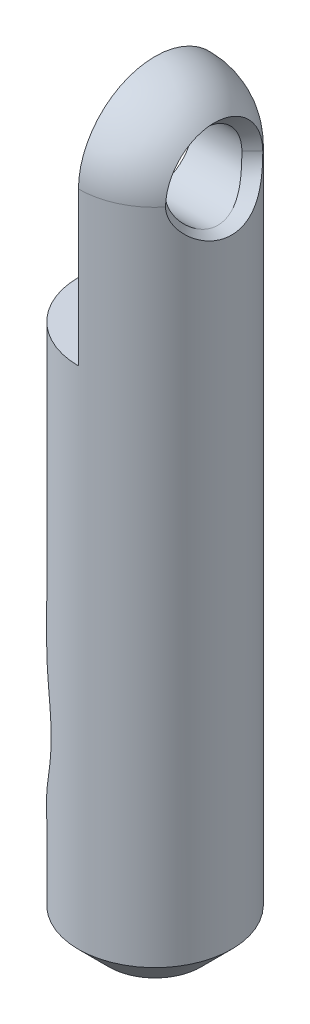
ISO-10303-21;
HEADER;
FILE_DESCRIPTION(('STEP AP214'),'2;1');
FILE_NAME('part.step','',(''),(''),'','','');
FILE_SCHEMA(('AUTOMOTIVE_DESIGN { 1 0 10303 214 1 1 1 1 }'));
ENDSEC;
DATA;
#1=APPLICATION_CONTEXT('core data for automotive mechanical design processes');
#2=APPLICATION_PROTOCOL_DEFINITION('international standard','automotive_design',2000,#1);
#3=PRODUCT_CONTEXT('',#1,'mechanical');
#4=PRODUCT('Part','Part','',(#3));
#5=PRODUCT_RELATED_PRODUCT_CATEGORY('part','',(#4));
#6=PRODUCT_DEFINITION_FORMATION('','',#4);
#7=PRODUCT_DEFINITION_CONTEXT('part definition',#1,'design');
#8=PRODUCT_DEFINITION('design','',#6,#7);
#9=PRODUCT_DEFINITION_SHAPE('','',#8);
#10=(LENGTH_UNIT() NAMED_UNIT(*) SI_UNIT(.MILLI.,.METRE.));
#11=(NAMED_UNIT(*) PLANE_ANGLE_UNIT() SI_UNIT($,.RADIAN.));
#12=(NAMED_UNIT(*) SI_UNIT($,.STERADIAN.) SOLID_ANGLE_UNIT());
#13=UNCERTAINTY_MEASURE_WITH_UNIT(LENGTH_MEASURE(1.E-05),#10,'distance_accuracy_value','');
#14=(GEOMETRIC_REPRESENTATION_CONTEXT(3) GLOBAL_UNCERTAINTY_ASSIGNED_CONTEXT((#13)) GLOBAL_UNIT_ASSIGNED_CONTEXT((#10,
#11,#12)) REPRESENTATION_CONTEXT('',''));
#15=CARTESIAN_POINT('',(0.,0.,0.));
#16=DIRECTION('',(0.,0.,1.));
#17=DIRECTION('',(1.,0.,0.));
#18=AXIS2_PLACEMENT_3D('',#15,#16,#17);
#19=CARTESIAN_POINT('',(1.99999999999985,12.5,-14.3835569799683));
#20=DIRECTION('',(1.,0.,0.));
#21=DIRECTION('',(0.,0.,-1.));
#22=AXIS2_PLACEMENT_3D('',#19,#20,#21);
#23=PLANE('',#22);
#24=CARTESIAN_POINT('',(2.,12.5,0.));
#25=DIRECTION('',(-1.,0.,0.));
#26=DIRECTION('',(0.,0.,1.));
#27=AXIS2_PLACEMENT_3D('',#24,#25,#26);
#28=CIRCLE('',#27,0.0500000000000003);
#29=CARTESIAN_POINT('',(2.,12.5,0.0500000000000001));
#30=VERTEX_POINT('',#29);
#31=EDGE_CURVE('E33',#30,#30,#28,.T.);
#32=ORIENTED_EDGE('',*,*,#31,.T.);
#33=EDGE_LOOP('',(#32));
#34=FACE_BOUND('',#33,.T.);
#35=ADVANCED_FACE('F15',(#34),#23,.F.);
#36=CARTESIAN_POINT('',(0.,45.,0.));
#37=DIRECTION('',(1.,0.,0.));
#38=DIRECTION('',(0.,0.,-1.));
#39=AXIS2_PLACEMENT_3D('',#36,#37,#38);
#40=CYLINDRICAL_SURFACE('',#39,2.5);
#41=CARTESIAN_POINT('',(3.16975103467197,45.0000000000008,-2.5));
#42=CARTESIAN_POINT('',(3.16974606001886,44.9449337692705,-2.50001063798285));
#43=CARTESIAN_POINT('',(3.17131437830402,44.8898744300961,-2.49818118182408));
#44=CARTESIAN_POINT('',(3.17749167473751,44.7802108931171,-2.49092257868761));
#45=CARTESIAN_POINT('',(3.18209807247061,44.7256063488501,-2.48549648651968));
#46=CARTESIAN_POINT('',(3.19420160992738,44.6175946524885,-2.47117731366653));
#47=CARTESIAN_POINT('',(3.20167740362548,44.5641816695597,-2.46230982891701));
#48=CARTESIAN_POINT('',(3.21914101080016,44.458432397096,-2.44123141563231));
#49=CARTESIAN_POINT('',(3.2291293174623,44.4060963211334,-2.42901983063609));
#50=CARTESIAN_POINT('',(3.25157104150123,44.3019132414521,-2.40117286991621));
#51=CARTESIAN_POINT('',(3.26406270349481,44.2500888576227,-2.38548391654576));
#52=CARTESIAN_POINT('',(3.29108102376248,44.1480478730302,-2.35097404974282));
#53=CARTESIAN_POINT('',(3.30560761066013,44.0978312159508,-2.33215324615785));
#54=CARTESIAN_POINT('',(3.3363632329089,43.9990450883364,-2.29149468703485));
#55=CARTESIAN_POINT('',(3.35259565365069,43.9504791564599,-2.26965090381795));
#56=CARTESIAN_POINT('',(3.38632077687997,43.8551988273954,-2.22311560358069));
#57=CARTESIAN_POINT('',(3.40381360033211,43.8084846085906,-2.19842381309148));
#58=CARTESIAN_POINT('',(3.46526866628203,43.651960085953,-2.10927243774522));
#59=CARTESIAN_POINT('',(3.51155144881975,43.5467284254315,-2.03812261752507));
#60=CARTESIAN_POINT('',(3.58182649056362,43.398158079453,-1.9204440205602));
#61=CARTESIAN_POINT('',(3.60541149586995,43.3501479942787,-1.87935690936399));
#62=CARTESIAN_POINT('',(3.65248382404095,43.2573301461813,-1.79362490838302));
#63=CARTESIAN_POINT('',(3.67597114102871,43.2125225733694,-1.74897980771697));
#64=CARTESIAN_POINT('',(3.72644691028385,43.1187172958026,-1.64812534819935));
#65=CARTESIAN_POINT('',(3.75332686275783,43.0703631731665,-1.5912611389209));
#66=CARTESIAN_POINT('',(3.80539970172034,42.9785957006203,-1.47293109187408));
#67=CARTESIAN_POINT('',(3.83059230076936,42.935183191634,-1.41146447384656));
#68=CARTESIAN_POINT('',(3.87882200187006,42.8537954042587,-1.28432831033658));
#69=CARTESIAN_POINT('',(3.90186134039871,42.815814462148,-1.21866324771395));
#70=CARTESIAN_POINT('',(3.94514249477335,42.7456710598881,-1.08342042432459));
#71=CARTESIAN_POINT('',(3.96538505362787,42.713507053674,-1.01384370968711));
#72=CARTESIAN_POINT('',(3.99873042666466,42.6609295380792,-0.884675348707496));
#73=CARTESIAN_POINT('',(4.01245961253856,42.6394440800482,-0.825680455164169));
#74=CARTESIAN_POINT('',(4.03715549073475,42.6008497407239,-0.705723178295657));
#75=CARTESIAN_POINT('',(4.04812287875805,42.5837397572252,-0.644761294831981));
#76=CARTESIAN_POINT('',(4.06715547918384,42.5541366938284,-0.521323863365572));
#77=CARTESIAN_POINT('',(4.07522272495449,42.5416403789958,-0.458849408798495));
#78=CARTESIAN_POINT('',(4.08821490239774,42.5214273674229,-0.332794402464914));
#79=CARTESIAN_POINT('',(4.0931388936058,42.5137121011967,-0.269213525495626));
#80=CARTESIAN_POINT('',(4.10039980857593,42.5031674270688,-0.141286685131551));
#81=CARTESIAN_POINT('',(4.10272811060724,42.500354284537,-0.0769388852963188));
#82=CARTESIAN_POINT('',(4.10390895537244,42.4997089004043,0.0518022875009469));
#83=CARTESIAN_POINT('',(4.10276294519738,42.5018745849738,0.116195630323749));
#84=CARTESIAN_POINT('',(4.09667214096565,42.5111485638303,0.244445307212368));
#85=CARTESIAN_POINT('',(4.09172707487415,42.5182572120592,0.308301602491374));
#86=CARTESIAN_POINT('',(4.07856688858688,42.5372949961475,0.434958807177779));
#87=CARTESIAN_POINT('',(4.07035059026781,42.5492258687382,0.497759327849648));
#88=CARTESIAN_POINT('',(4.05229545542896,42.5765010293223,0.616463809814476));
#89=CARTESIAN_POINT('',(4.04266195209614,42.5914544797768,0.67248979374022));
#90=CARTESIAN_POINT('',(4.02118099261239,42.6250690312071,0.782966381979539));
#91=CARTESIAN_POINT('',(4.00933422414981,42.6437289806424,0.837417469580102));
#92=CARTESIAN_POINT('',(3.98354579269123,42.6845611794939,0.944471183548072));
#93=CARTESIAN_POINT('',(3.96960409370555,42.7067334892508,0.997073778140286));
#94=CARTESIAN_POINT('',(3.93991703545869,42.7543995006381,1.10023074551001));
#95=CARTESIAN_POINT('',(3.9241713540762,42.7798937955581,1.15078475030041));
#96=CARTESIAN_POINT('',(3.88930422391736,42.8370666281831,1.25525025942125));
#97=CARTESIAN_POINT('',(3.87000233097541,42.8691183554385,1.30889739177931));
#98=CARTESIAN_POINT('',(3.82990477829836,42.9368515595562,1.4132546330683));
#99=CARTESIAN_POINT('',(3.80910907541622,42.9725331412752,1.46396465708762));
#100=CARTESIAN_POINT('',(3.76637884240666,43.047343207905,1.5623558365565));
#101=CARTESIAN_POINT('',(3.7444432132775,43.0864750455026,1.61003396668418));
#102=CARTESIAN_POINT('',(3.71109599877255,43.1476099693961,1.67916541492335));
#103=CARTESIAN_POINT('',(3.6999057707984,43.1683954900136,1.70181259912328));
#104=CARTESIAN_POINT('',(3.67736588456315,43.2107456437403,1.74628558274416));
#105=CARTESIAN_POINT('',(3.66601618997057,43.2323104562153,1.76811119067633));
#106=CARTESIAN_POINT('',(3.60194035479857,43.3558304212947,1.88860395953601));
#107=CARTESIAN_POINT('',(3.54835714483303,43.4658431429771,1.97903858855));
#108=CARTESIAN_POINT('',(3.48383926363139,43.6124039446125,2.07986748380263));
#109=CARTESIAN_POINT('',(3.47104737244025,43.6421959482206,2.09943930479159));
#110=CARTESIAN_POINT('',(3.44585262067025,43.7027107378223,2.13736131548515));
#111=CARTESIAN_POINT('',(3.4334496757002,43.7334333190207,2.15571177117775));
#112=CARTESIAN_POINT('',(3.40906551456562,43.7957585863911,2.19113850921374));
#113=CARTESIAN_POINT('',(3.39708423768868,43.8273611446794,2.20821497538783));
#114=CARTESIAN_POINT('',(3.3736316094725,43.8914231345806,2.24106078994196));
#115=CARTESIAN_POINT('',(3.36216025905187,43.9238825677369,2.25683013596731));
#116=CARTESIAN_POINT('',(3.33322630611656,44.0094224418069,2.29610772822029));
#117=CARTESIAN_POINT('',(3.31630595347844,44.063172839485,2.31857182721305));
#118=CARTESIAN_POINT('',(3.28451843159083,44.172648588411,2.35985461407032));
#119=CARTESIAN_POINT('',(3.26965124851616,44.2283739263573,2.37867332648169));
#120=CARTESIAN_POINT('',(3.24263742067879,44.341453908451,2.41242337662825));
#121=CARTESIAN_POINT('',(3.23048298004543,44.3988033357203,2.42736587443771));
#122=CARTESIAN_POINT('',(3.20919916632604,44.5149463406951,2.45321403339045));
#123=CARTESIAN_POINT('',(3.2000684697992,44.5737392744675,2.46412146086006));
#124=CARTESIAN_POINT('',(3.1889308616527,44.6632333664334,2.47740198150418));
#125=CARTESIAN_POINT('',(3.18562748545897,44.6935524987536,2.48133576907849));
#126=CARTESIAN_POINT('',(3.17990450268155,44.7543913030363,2.48809417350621));
#127=CARTESIAN_POINT('',(3.17748468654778,44.7849109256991,2.49091905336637));
#128=CARTESIAN_POINT('',(3.17357017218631,44.8461506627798,2.49545081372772));
#129=CARTESIAN_POINT('',(3.17207716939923,44.8768710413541,2.4971556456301));
#130=CARTESIAN_POINT('',(3.17064250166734,44.9230103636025,2.49886167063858));
#131=CARTESIAN_POINT('',(3.17029842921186,44.9384027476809,2.49928847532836));
#132=CARTESIAN_POINT('',(3.16985106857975,44.969196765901,2.49985766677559));
#133=CARTESIAN_POINT('',(3.16974778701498,44.9845984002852,2.500000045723));
#134=CARTESIAN_POINT('',(3.16975103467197,45.,2.5));
#135=B_SPLINE_CURVE_WITH_KNOTS('',3,(#41,#42,#43,#44,#45,#46,#47,#48,#49,#50,#51,#52,#53,#54,
#55,#56,#57,#58,#59,#60,#61,#62,#63,#64,#65,#66,#67,#68,#69,#70,#71,#72,#73,#74,#75,#76,#77,#78,
#79,#80,#81,#82,#83,#84,#85,#86,#87,#88,#89,#90,#91,#92,#93,#94,#95,#96,#97,#98,#99,#100,#101,
#102,#103,#104,#105,#106,#107,#108,#109,#110,#111,#112,#113,#114,#115,#116,#117,#118,#119,#120,
#121,#122,#123,#124,#125,#126,#127,#128,#129,#130,#131,#132,#133,#134),.UNSPECIFIED.,.F.,.F.,(4,
2,2,2,2,2,2,2,2,2,2,2,2,2,2,2,2,2,2,2,2,2,2,2,2,2,2,2,2,2,2,2,2,2,2,2,2,2,2,2,2,2,2,2,2,2,4),
(0.,0.165136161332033,0.3301322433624,0.493923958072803,0.65774784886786,0.824297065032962,
0.990840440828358,1.15772081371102,1.32461722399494,1.72845982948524,1.9306875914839,
2.13292734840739,2.37064029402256,2.60839363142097,2.84589721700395,3.08333758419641,
3.27592238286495,3.46845862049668,3.66085960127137,3.85331812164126,4.04641401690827,
4.2394294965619,4.43245879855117,4.62555768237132,4.80173171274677,4.97785109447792,
5.1539735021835,5.3301274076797,5.52614833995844,5.7221749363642,5.91839416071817,
6.01651285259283,6.1146542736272,6.56853547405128,6.68214264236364,6.79572498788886,
6.90929091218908,7.02285704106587,7.20466955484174,7.38648084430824,7.56776271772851,
7.74896514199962,7.84118966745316,7.93339230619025,8.02576312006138,8.07196541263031,
8.11816897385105),.UNSPECIFIED.);
#136=CARTESIAN_POINT('',(3.16975103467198,45.0000000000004,-2.5));
#137=VERTEX_POINT('',#136);
#138=CARTESIAN_POINT('',(3.16975103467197,45.,2.5));
#139=VERTEX_POINT('',#138);
#140=EDGE_CURVE('E71',#137,#139,#135,.T.);
#141=ORIENTED_EDGE('',*,*,#140,.F.);
#142=CARTESIAN_POINT('',(3.16975103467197,45.,2.5));
#143=CARTESIAN_POINT('',(3.16976240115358,45.0703160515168,2.50000666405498));
#144=CARTESIAN_POINT('',(3.16975973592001,45.1406267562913,2.49703350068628));
#145=CARTESIAN_POINT('',(3.16974989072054,45.2807451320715,2.48517943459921));
#146=CARTESIAN_POINT('',(3.16974271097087,45.3505528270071,2.47629881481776));
#147=CARTESIAN_POINT('',(3.16974738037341,45.4891309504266,2.45269004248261));
#148=CARTESIAN_POINT('',(3.16975921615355,45.5579020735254,2.43796600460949));
#149=CARTESIAN_POINT('',(3.16974987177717,45.6599274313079,2.41158268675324));
#150=CARTESIAN_POINT('',(3.16974223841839,45.6937508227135,2.40207081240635));
#151=CARTESIAN_POINT('',(3.16976005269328,45.7609688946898,2.38162969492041));
#152=CARTESIAN_POINT('',(3.16978550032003,45.79436357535,2.37070045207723));
#153=CARTESIAN_POINT('',(3.16980780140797,45.8606781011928,2.34743869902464));
#154=CARTESIAN_POINT('',(3.16980464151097,45.8935977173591,2.33510553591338));
#155=CARTESIAN_POINT('',(3.16977467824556,45.9588857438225,2.30906339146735));
#156=CARTESIAN_POINT('',(3.1697478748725,45.9912541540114,2.29535440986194));
#157=CARTESIAN_POINT('',(3.16971927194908,46.0874472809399,2.25219792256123));
#158=CARTESIAN_POINT('',(3.16976924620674,46.1503740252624,2.2207159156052));
#159=CARTESIAN_POINT('',(3.16975823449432,46.2733303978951,2.15257310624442));
#160=CARTESIAN_POINT('',(3.16969727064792,46.3333606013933,2.11591333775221));
#161=CARTESIAN_POINT('',(3.16969877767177,46.4501217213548,2.03766658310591));
#162=CARTESIAN_POINT('',(3.16976124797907,46.5068526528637,1.99607961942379));
#163=CARTESIAN_POINT('',(3.1698064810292,46.616610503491,1.90827409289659));
#164=CARTESIAN_POINT('',(3.16978924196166,46.6696373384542,1.86205542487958));
#165=CARTESIAN_POINT('',(3.1697395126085,46.7716095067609,1.76531554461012));
#166=CARTESIAN_POINT('',(3.16970702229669,46.8205548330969,1.71479432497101));
#167=CARTESIAN_POINT('',(3.16967114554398,46.9140229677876,1.60980018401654));
#168=CARTESIAN_POINT('',(3.16966776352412,46.9585451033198,1.55532666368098));
#169=CARTESIAN_POINT('',(3.16972262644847,47.0428414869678,1.44282365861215));
#170=CARTESIAN_POINT('',(3.16978087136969,47.0826157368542,1.38479417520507));
#171=CARTESIAN_POINT('',(3.16985860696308,47.1571332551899,1.26558853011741));
#172=CARTESIAN_POINT('',(3.16987809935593,47.191876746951,1.20441250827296));
#173=CARTESIAN_POINT('',(3.16985924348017,47.2560828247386,1.0793684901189));
#174=CARTESIAN_POINT('',(3.16982089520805,47.2855454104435,1.01550049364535));
#175=CARTESIAN_POINT('',(3.16964337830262,47.3656745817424,0.820539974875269));
#176=CARTESIAN_POINT('',(3.16944178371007,47.4081543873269,0.685975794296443));
#177=CARTESIAN_POINT('',(3.16944916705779,47.4698866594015,0.411619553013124));
#178=CARTESIAN_POINT('',(3.16965814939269,47.4891388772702,0.271827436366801));
#179=CARTESIAN_POINT('',(3.16979060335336,47.5002393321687,0.0613356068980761));
#180=CARTESIAN_POINT('',(3.16980454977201,47.5009727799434,-0.00899452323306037));
#181=CARTESIAN_POINT('',(3.1697827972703,47.4965150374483,-0.149484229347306));
#182=CARTESIAN_POINT('',(3.16974709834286,47.4913238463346,-0.219643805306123));
#183=CARTESIAN_POINT('',(3.16965952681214,47.4750488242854,-0.359271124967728));
#184=CARTESIAN_POINT('',(3.16960765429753,47.4639650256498,-0.428738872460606));
#185=CARTESIAN_POINT('',(3.16959858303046,47.4359849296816,-0.566494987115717));
#186=CARTESIAN_POINT('',(3.16964138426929,47.4190886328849,-0.634783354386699));
#187=CARTESIAN_POINT('',(3.1697601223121,47.3796033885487,-0.76969337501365));
#188=CARTESIAN_POINT('',(3.16983605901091,47.3570144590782,-0.83631503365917));
#189=CARTESIAN_POINT('',(3.16994513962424,47.3063045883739,-0.967418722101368));
#190=CARTESIAN_POINT('',(3.16997828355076,47.2781836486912,-1.03190075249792));
#191=CARTESIAN_POINT('',(3.16998423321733,47.2166092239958,-1.15826751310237));
#192=CARTESIAN_POINT('',(3.16995703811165,47.1831556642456,-1.22015220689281));
#193=CARTESIAN_POINT('',(3.16985934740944,47.1111533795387,-1.34088466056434));
#194=CARTESIAN_POINT('',(3.16978885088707,47.0726045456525,-1.39973235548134));
#195=CARTESIAN_POINT('',(3.1696891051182,46.9906887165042,-1.51396767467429));
#196=CARTESIAN_POINT('',(3.16965985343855,46.9473220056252,-1.56935550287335));
#197=CARTESIAN_POINT('',(3.16965789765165,46.8560769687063,-1.67628098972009));
#198=CARTESIAN_POINT('',(3.16968519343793,46.8081986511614,-1.72781865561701));
#199=CARTESIAN_POINT('',(3.16972595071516,46.7082766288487,-1.82667168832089));
#200=CARTESIAN_POINT('',(3.16973941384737,46.6562334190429,-1.87398755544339));
#201=CARTESIAN_POINT('',(3.16977300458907,46.5483477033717,-1.96406661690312));
#202=CARTESIAN_POINT('',(3.16979313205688,46.4925052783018,-2.00682990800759));
#203=CARTESIAN_POINT('',(3.16980973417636,46.3773971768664,-2.08751496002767));
#204=CARTESIAN_POINT('',(3.16980620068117,46.3181303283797,-2.12543504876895));
#205=CARTESIAN_POINT('',(3.16976939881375,46.1966142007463,-2.1961456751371));
#206=CARTESIAN_POINT('',(3.16973613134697,46.1343650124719,-2.22893636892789));
#207=CARTESIAN_POINT('',(3.16969014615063,46.0072894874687,-2.28917341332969));
#208=CARTESIAN_POINT('',(3.16967744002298,45.9424617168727,-2.3166167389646));
#209=CARTESIAN_POINT('',(3.16969780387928,45.8107146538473,-2.36594373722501));
#210=CARTESIAN_POINT('',(3.16973087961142,45.7437950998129,-2.38782671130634));
#211=CARTESIAN_POINT('',(3.16981678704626,45.6084427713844,-2.42584680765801));
#212=CARTESIAN_POINT('',(3.16986959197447,45.5400121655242,-2.4419916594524));
#213=CARTESIAN_POINT('',(3.16991590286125,45.4020616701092,-2.46845606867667));
#214=CARTESIAN_POINT('',(3.16990943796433,45.3325423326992,-2.47877848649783));
#215=CARTESIAN_POINT('',(3.16985674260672,45.2190597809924,-2.49077133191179));
#216=CARTESIAN_POINT('',(3.16982631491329,45.1752781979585,-2.49423428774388));
#217=CARTESIAN_POINT('',(3.16977456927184,45.0876659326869,-2.49884696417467));
#218=CARTESIAN_POINT('',(3.16975323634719,45.0438354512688,-2.50000049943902));
#219=CARTESIAN_POINT('',(3.16975103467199,45.,-2.5));
#220=B_SPLINE_CURVE_WITH_KNOTS('',3,(#142,#143,#144,#145,#146,#147,#148,#149,#150,#151,#152,
#153,#154,#155,#156,#157,#158,#159,#160,#161,#162,#163,#164,#165,#166,#167,#168,#169,#170,#171,
#172,#173,#174,#175,#176,#177,#178,#179,#180,#181,#182,#183,#184,#185,#186,#187,#188,#189,#190,
#191,#192,#193,#194,#195,#196,#197,#198,#199,#200,#201,#202,#203,#204,#205,#206,#207,#208,#209,
#210,#211,#212,#213,#214,#215,#216,#217,#218,#219),.UNSPECIFIED.,.F.,.F.,(4,2,2,2,2,2,2,2,2,2,2,
2,2,2,2,2,2,2,2,2,2,2,2,2,2,2,2,2,2,2,2,2,2,2,2,2,2,2,4),(0.,0.210875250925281,
0.421740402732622,0.632457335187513,0.737837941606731,0.843218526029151,0.948648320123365,
1.05407813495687,1.26489297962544,1.47566578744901,1.68643763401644,1.89721426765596,
2.10799126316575,2.31880027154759,2.52960920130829,2.74040877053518,2.95120835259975,
3.37240564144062,3.79360743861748,4.00440061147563,4.21519381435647,4.42598586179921,
4.6367778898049,4.84756924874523,5.05836054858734,5.26915480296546,5.47995356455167,
5.69073988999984,5.90152581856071,6.11228673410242,6.3230431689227,6.53387217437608,
6.74469475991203,6.95563626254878,7.16660425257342,7.37728697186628,7.58786609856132,
7.71956511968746,7.8510464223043),.UNSPECIFIED.);
#221=EDGE_CURVE('E18',#139,#137,#220,.T.);
#222=ORIENTED_EDGE('',*,*,#221,.F.);
#223=EDGE_LOOP('',(#141,#222));
#224=FACE_BOUND('',#223,.T.);
#225=CARTESIAN_POINT('',(0.,45.,0.));
#226=DIRECTION('',(1.,0.,0.));
#227=DIRECTION('',(0.,0.,-1.));
#228=AXIS2_PLACEMENT_3D('',#225,#226,#227);
#229=CIRCLE('',#228,2.5);
#230=CARTESIAN_POINT('',(0.,45.,-2.5));
#231=VERTEX_POINT('',#230);
#232=EDGE_CURVE('E132',#231,#231,#229,.F.);
#233=ORIENTED_EDGE('',*,*,#232,.T.);
#234=EDGE_LOOP('',(#233));
#235=FACE_BOUND('',#234,.T.);
#236=ADVANCED_FACE('F72',(#224,#235),#40,.F.);
#237=CARTESIAN_POINT('',(3.87025707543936,45.,3.1808150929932));
#238=CARTESIAN_POINT('',(3.87025707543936,45.0399891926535,3.1808150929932));
#239=CARTESIAN_POINT('',(3.87025707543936,45.117131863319,3.17932039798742));
#240=CARTESIAN_POINT('',(3.87025707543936,45.234827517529,3.17297624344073));
#241=CARTESIAN_POINT('',(3.87025707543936,45.3769703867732,3.15972047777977));
#242=CARTESIAN_POINT('',(3.87025707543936,45.5484056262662,3.13499339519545));
#243=CARTESIAN_POINT('',(3.87025707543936,45.7336924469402,3.09703242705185));
#244=CARTESIAN_POINT('',(3.87025707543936,45.9879628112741,3.02869445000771));
#245=CARTESIAN_POINT('',(3.87025707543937,46.3103826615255,2.9081551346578));
#246=CARTESIAN_POINT('',(3.87025707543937,46.6651741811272,2.71931918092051));
#247=CARTESIAN_POINT('',(3.87025707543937,46.9691558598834,2.50662452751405));
#248=CARTESIAN_POINT('',(3.87025707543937,47.2383514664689,2.26929807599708));
#249=CARTESIAN_POINT('',(3.87025707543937,47.7191088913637,1.73935306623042));
#250=CARTESIAN_POINT('',(3.87025707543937,48.203035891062,0.752569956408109));
#251=CARTESIAN_POINT('',(3.87025707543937,48.2114520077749,-0.713746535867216));
#252=CARTESIAN_POINT('',(3.87025707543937,47.6876392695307,-1.81636686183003));
#253=CARTESIAN_POINT('',(3.87025707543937,47.012243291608,-2.49791669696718));
#254=CARTESIAN_POINT('',(3.87025707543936,46.4055727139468,-2.88320961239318));
#255=CARTESIAN_POINT('',(3.87025707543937,45.7299911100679,-3.12371162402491));
#256=CARTESIAN_POINT('',(3.87025707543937,45.2436396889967,-3.18081509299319));
#257=CARTESIAN_POINT('',(3.87025707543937,45.,-3.18081509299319));
#258=CARTESIAN_POINT('',(3.86794517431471,45.,3.17856817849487));
#259=CARTESIAN_POINT('',(3.86794517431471,45.0399609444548,3.17856817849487));
#260=CARTESIAN_POINT('',(3.86794517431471,45.1170491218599,3.1770745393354));
#261=CARTESIAN_POINT('',(3.86794517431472,45.2346616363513,3.17073486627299));
#262=CARTESIAN_POINT('',(3.86794517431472,45.3767040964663,3.15748846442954));
#263=CARTESIAN_POINT('',(3.86794517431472,45.5480182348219,3.13277884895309));
#264=CARTESIAN_POINT('',(3.86794517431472,45.7331741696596,3.09484469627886));
#265=CARTESIAN_POINT('',(3.86794517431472,45.9872649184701,3.02655499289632));
#266=CARTESIAN_POINT('',(3.86794517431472,46.3094570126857,2.90610082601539));
#267=CARTESIAN_POINT('',(3.86794517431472,46.6639979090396,2.71739826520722));
#268=CARTESIAN_POINT('',(3.86794517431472,46.9677648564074,2.5048538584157));
#269=CARTESIAN_POINT('',(3.86794517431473,47.2367703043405,2.26769505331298));
#270=CARTESIAN_POINT('',(3.86794517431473,47.7171881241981,1.73812439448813));
#271=CARTESIAN_POINT('',(3.86794517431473,48.2007732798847,0.7520383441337));
#272=CARTESIAN_POINT('',(3.86794517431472,48.2091834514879,-0.713242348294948));
#273=CARTESIAN_POINT('',(3.86794517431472,47.6857407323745,-1.81508378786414));
#274=CARTESIAN_POINT('',(3.86794517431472,47.0108218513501,-2.49615217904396));
#275=CARTESIAN_POINT('',(3.86794517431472,46.4045798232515,-2.88117292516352));
#276=CARTESIAN_POINT('',(3.86794517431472,45.7294754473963,-3.1215050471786));
#277=CARTESIAN_POINT('',(3.86794517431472,45.2434675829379,-3.17856817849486));
#278=CARTESIAN_POINT('',(3.86794517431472,45.,-3.17856817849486));
#279=CARTESIAN_POINT('',(3.86563327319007,45.,3.17632126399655));
#280=CARTESIAN_POINT('',(3.86563327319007,45.0399326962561,3.17632126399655));
#281=CARTESIAN_POINT('',(3.86563327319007,45.1169663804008,3.17482868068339));
#282=CARTESIAN_POINT('',(3.86563327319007,45.2344957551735,3.16849348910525));
#283=CARTESIAN_POINT('',(3.86563327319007,45.3764378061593,3.1552564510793));
#284=CARTESIAN_POINT('',(3.86563327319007,45.5476308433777,3.13056430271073));
#285=CARTESIAN_POINT('',(3.86563327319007,45.732655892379,3.09265696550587));
#286=CARTESIAN_POINT('',(3.86563327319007,45.986567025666,3.02441553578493));
#287=CARTESIAN_POINT('',(3.86563327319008,46.3085313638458,2.90404651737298));
#288=CARTESIAN_POINT('',(3.86563327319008,46.6628216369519,2.71547734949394));
#289=CARTESIAN_POINT('',(3.86563327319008,46.9663738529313,2.50308318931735));
#290=CARTESIAN_POINT('',(3.86563327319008,47.2351891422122,2.26609203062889));
#291=CARTESIAN_POINT('',(3.86563327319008,47.7152673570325,1.73689572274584));
#292=CARTESIAN_POINT('',(3.86563327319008,48.1985106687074,0.751506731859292));
#293=CARTESIAN_POINT('',(3.86563327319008,48.206914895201,-0.712738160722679));
#294=CARTESIAN_POINT('',(3.86563327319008,47.6838421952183,-1.81380071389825));
#295=CARTESIAN_POINT('',(3.86563327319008,47.0094004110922,-2.49438766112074));
#296=CARTESIAN_POINT('',(3.86563327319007,46.4035869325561,-2.87913623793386));
#297=CARTESIAN_POINT('',(3.86563327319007,45.7289597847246,-3.11929847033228));
#298=CARTESIAN_POINT('',(3.86563327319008,45.243295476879,-3.17632126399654));
#299=CARTESIAN_POINT('',(3.86563327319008,45.,-3.17632126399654));
#300=CARTESIAN_POINT('',(3.86332137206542,45.,3.17407434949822));
#301=CARTESIAN_POINT('',(3.86332137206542,45.0399044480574,3.17407434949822));
#302=CARTESIAN_POINT('',(3.86332137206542,45.1168836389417,3.17258282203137));
#303=CARTESIAN_POINT('',(3.86332137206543,45.2343298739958,3.16625211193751));
#304=CARTESIAN_POINT('',(3.86332137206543,45.3761715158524,3.15302443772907));
#305=CARTESIAN_POINT('',(3.86332137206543,45.5472434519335,3.12834975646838));
#306=CARTESIAN_POINT('',(3.86332137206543,45.7321376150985,3.09046923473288));
#307=CARTESIAN_POINT('',(3.86332137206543,45.9858691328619,3.02227607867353));
#308=CARTESIAN_POINT('',(3.86332137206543,46.307605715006,2.90199220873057));
#309=CARTESIAN_POINT('',(3.86332137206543,46.6616453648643,2.71355643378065));
#310=CARTESIAN_POINT('',(3.86332137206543,46.9649828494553,2.50131252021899));
#311=CARTESIAN_POINT('',(3.86332137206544,47.2336079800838,2.26448900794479));
#312=CARTESIAN_POINT('',(3.86332137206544,47.7133465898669,1.73566705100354));
#313=CARTESIAN_POINT('',(3.86332137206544,48.1962480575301,0.750975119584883));
#314=CARTESIAN_POINT('',(3.86332137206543,48.204646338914,-0.712233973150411));
#315=CARTESIAN_POINT('',(3.86332137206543,47.6819436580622,-1.81251763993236));
#316=CARTESIAN_POINT('',(3.86332137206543,47.0079789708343,-2.49262314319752));
#317=CARTESIAN_POINT('',(3.86332137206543,46.4025940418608,-2.87709955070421));
#318=CARTESIAN_POINT('',(3.86332137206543,45.728444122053,-3.11709189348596));
#319=CARTESIAN_POINT('',(3.86332137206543,45.2431233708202,-3.17407434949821));
#320=CARTESIAN_POINT('',(3.86332137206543,45.,-3.17407434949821));
#321=CARTESIAN_POINT('',(3.63213125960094,45.,2.94938289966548));
#322=CARTESIAN_POINT('',(3.63213125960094,45.0370796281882,2.94938289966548));
#323=CARTESIAN_POINT('',(3.63213125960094,45.1086094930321,2.94799695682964));
#324=CARTESIAN_POINT('',(3.63213125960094,45.2177417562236,2.94211439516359));
#325=CARTESIAN_POINT('',(3.63213125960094,45.3495424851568,2.92982310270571));
#326=CARTESIAN_POINT('',(3.63213125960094,45.5085043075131,2.90689513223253));
#327=CARTESIAN_POINT('',(3.63213125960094,45.680309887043,2.87169615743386));
#328=CARTESIAN_POINT('',(3.63213125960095,45.9160798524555,2.80833036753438));
#329=CARTESIAN_POINT('',(3.63213125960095,46.2150408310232,2.69656134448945));
#330=CARTESIAN_POINT('',(3.63213125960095,46.5440181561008,2.52146486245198));
#331=CARTESIAN_POINT('',(3.63213125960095,46.8258825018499,2.32424561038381));
#332=CARTESIAN_POINT('',(3.63213125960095,47.0754917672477,2.10418673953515));
#333=CARTESIAN_POINT('',(3.63213125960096,47.5212698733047,1.61279987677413));
#334=CARTESIAN_POINT('',(3.63213125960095,47.9699869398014,0.697813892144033));
#335=CARTESIAN_POINT('',(3.63213125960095,47.9777907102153,-0.661815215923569));
#336=CARTESIAN_POINT('',(3.63213125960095,47.4920899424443,-1.68421024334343));
#337=CARTESIAN_POINT('',(3.63213125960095,46.8658349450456,-2.3161713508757));
#338=CARTESIAN_POINT('',(3.63213125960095,46.3033049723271,-2.67343082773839));
#339=CARTESIAN_POINT('',(3.63213125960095,45.6768778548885,-2.89643420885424));
#340=CARTESIAN_POINT('',(3.63213125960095,45.2259127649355,-2.94938289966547));
#341=CARTESIAN_POINT('',(3.63213125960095,45.,-2.94938289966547));
#342=CARTESIAN_POINT('',(3.40094114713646,45.,2.72469144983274));
#343=CARTESIAN_POINT('',(3.40094114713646,45.034254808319,2.72469144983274));
#344=CARTESIAN_POINT('',(3.40094114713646,45.1003353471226,2.72341109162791));
#345=CARTESIAN_POINT('',(3.40094114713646,45.2011536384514,2.71797667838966));
#346=CARTESIAN_POINT('',(3.40094114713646,45.3229134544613,2.70662176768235));
#347=CARTESIAN_POINT('',(3.40094114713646,45.4697651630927,2.68544050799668));
#348=CARTESIAN_POINT('',(3.40094114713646,45.6284821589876,2.65292308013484));
#349=CARTESIAN_POINT('',(3.40094114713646,45.846290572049,2.59438465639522));
#350=CARTESIAN_POINT('',(3.40094114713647,46.1224759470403,2.49113048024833));
#351=CARTESIAN_POINT('',(3.40094114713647,46.4263909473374,2.32937329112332));
#352=CARTESIAN_POINT('',(3.40094114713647,46.6867821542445,2.14717870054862));
#353=CARTESIAN_POINT('',(3.40094114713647,46.9173755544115,1.94388447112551));
#354=CARTESIAN_POINT('',(3.40094114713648,47.3291931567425,1.48993270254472));
#355=CARTESIAN_POINT('',(3.40094114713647,47.7437258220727,0.644652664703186));
#356=CARTESIAN_POINT('',(3.40094114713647,47.7509350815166,-0.611396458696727));
#357=CARTESIAN_POINT('',(3.40094114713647,47.3022362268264,-1.55590284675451));
#358=CARTESIAN_POINT('',(3.40094114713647,46.7236909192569,-2.13971955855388));
#359=CARTESIAN_POINT('',(3.40094114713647,46.2040159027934,-2.46976210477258));
#360=CARTESIAN_POINT('',(3.40094114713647,45.625311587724,-2.67577652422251));
#361=CARTESIAN_POINT('',(3.40094114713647,45.2087021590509,-2.72469144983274));
#362=CARTESIAN_POINT('',(3.40094114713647,45.,-2.72469144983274));
#363=CARTESIAN_POINT('',(3.16975103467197,45.,2.5));
#364=CARTESIAN_POINT('',(3.16975103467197,45.0314299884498,2.5));
#365=CARTESIAN_POINT('',(3.16975103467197,45.092061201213,2.49882522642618));
#366=CARTESIAN_POINT('',(3.16975103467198,45.1845655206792,2.49383896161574));
#367=CARTESIAN_POINT('',(3.16975103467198,45.2962844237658,2.48342043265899));
#368=CARTESIAN_POINT('',(3.16975103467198,45.4310260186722,2.46398588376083));
#369=CARTESIAN_POINT('',(3.16975103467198,45.5766544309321,2.43415000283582));
#370=CARTESIAN_POINT('',(3.16975103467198,45.7765012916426,2.38043894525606));
#371=CARTESIAN_POINT('',(3.16975103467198,46.0299110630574,2.28569961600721));
#372=CARTESIAN_POINT('',(3.16975103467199,46.3087637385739,2.13728171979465));
#373=CARTESIAN_POINT('',(3.16975103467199,46.5476818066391,1.97011179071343));
#374=CARTESIAN_POINT('',(3.16975103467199,46.7592593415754,1.78358220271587));
#375=CARTESIAN_POINT('',(3.169751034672,47.1371164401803,1.36706552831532));
#376=CARTESIAN_POINT('',(3.16975103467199,47.517464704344,0.591491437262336));
#377=CARTESIAN_POINT('',(3.16975103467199,47.524079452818,-0.560977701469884));
#378=CARTESIAN_POINT('',(3.16975103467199,47.1123825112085,-1.42759545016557));
#379=CARTESIAN_POINT('',(3.16975103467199,46.5815468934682,-1.96326776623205));
#380=CARTESIAN_POINT('',(3.16975103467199,46.1047268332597,-2.26609338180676));
#381=CARTESIAN_POINT('',(3.16975103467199,45.5737453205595,-2.45511883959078));
#382=CARTESIAN_POINT('',(3.16975103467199,45.1914915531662,-2.5));
#383=CARTESIAN_POINT('',(3.16975103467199,45.,-2.5));
#384=CARTESIAN_POINT('',(3.16741601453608,45.,2.49773061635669));
#385=CARTESIAN_POINT('',(3.16741601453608,45.0314014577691,2.49773061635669));
#386=CARTESIAN_POINT('',(3.16741601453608,45.0919776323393,2.49655690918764));
#387=CARTESIAN_POINT('',(3.16741601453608,45.1843979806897,2.49157517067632));
#388=CARTESIAN_POINT('',(3.16741601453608,45.2960154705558,2.48116609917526));
#389=CARTESIAN_POINT('',(3.16741601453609,45.4306347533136,2.46174919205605));
#390=CARTESIAN_POINT('',(3.16741601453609,45.5761309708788,2.4319403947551));
#391=CARTESIAN_POINT('',(3.16741601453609,45.7757964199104,2.37827809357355));
#392=CARTESIAN_POINT('',(3.16741601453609,46.0289761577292,2.28362476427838));
#393=CARTESIAN_POINT('',(3.16741601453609,46.3075757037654,2.13534159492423));
#394=CARTESIAN_POINT('',(3.1674160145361,46.5462768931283,1.96832341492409));
#395=CARTESIAN_POINT('',(3.1674160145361,46.7576623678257,1.78196314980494));
#396=CARTESIAN_POINT('',(3.16741601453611,47.135176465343,1.3658245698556));
#397=CARTESIAN_POINT('',(3.1674160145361,47.5151794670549,0.590954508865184));
#398=CARTESIAN_POINT('',(3.1674160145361,47.5217882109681,-0.560468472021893));
#399=CARTESIAN_POINT('',(3.1674160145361,47.1104649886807,-1.42629954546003));
#400=CARTESIAN_POINT('',(3.1674160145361,46.5801112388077,-1.9614856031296));
#401=CARTESIAN_POINT('',(3.1674160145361,46.1037240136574,-2.26403632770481));
#402=CARTESIAN_POINT('',(3.1674160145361,45.5732245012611,-2.452890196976));
#403=CARTESIAN_POINT('',(3.16741601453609,45.1913177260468,-2.49773061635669));
#404=CARTESIAN_POINT('',(3.16741601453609,45.,-2.49773061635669));
#405=CARTESIAN_POINT('',(3.16508099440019,45.,2.49546123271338));
#406=CARTESIAN_POINT('',(3.16508099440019,45.0313729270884,2.49546123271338));
#407=CARTESIAN_POINT('',(3.16508099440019,45.0918940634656,2.49428859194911));
#408=CARTESIAN_POINT('',(3.16508099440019,45.1842304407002,2.4893113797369));
#409=CARTESIAN_POINT('',(3.16508099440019,45.2957465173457,2.47891176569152));
#410=CARTESIAN_POINT('',(3.16508099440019,45.4302434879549,2.45951250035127));
#411=CARTESIAN_POINT('',(3.1650809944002,45.5756075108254,2.42973078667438));
#412=CARTESIAN_POINT('',(3.1650809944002,45.7750915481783,2.37611724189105));
#413=CARTESIAN_POINT('',(3.1650809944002,46.028041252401,2.28154991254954));
#414=CARTESIAN_POINT('',(3.1650809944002,46.3063876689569,2.13340147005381));
#415=CARTESIAN_POINT('',(3.16508099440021,46.5448719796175,1.96653503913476));
#416=CARTESIAN_POINT('',(3.16508099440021,46.7560653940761,1.780344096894));
#417=CARTESIAN_POINT('',(3.16508099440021,47.1332364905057,1.36458361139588));
#418=CARTESIAN_POINT('',(3.16508099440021,47.5128942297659,0.590417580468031));
#419=CARTESIAN_POINT('',(3.16508099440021,47.5194969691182,-0.559959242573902));
#420=CARTESIAN_POINT('',(3.16508099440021,47.108547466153,-1.42500364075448));
#421=CARTESIAN_POINT('',(3.16508099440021,46.5786755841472,-1.95970344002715));
#422=CARTESIAN_POINT('',(3.1650809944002,46.1027211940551,-2.26197927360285));
#423=CARTESIAN_POINT('',(3.1650809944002,45.5727036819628,-2.45066155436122));
#424=CARTESIAN_POINT('',(3.1650809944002,45.1911438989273,-2.49546123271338));
#425=CARTESIAN_POINT('',(3.1650809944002,45.,-2.49546123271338));
#426=CARTESIAN_POINT('',(3.1627459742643,45.,2.49319184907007));
#427=CARTESIAN_POINT('',(3.1627459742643,45.0313443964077,2.49319184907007));
#428=CARTESIAN_POINT('',(3.1627459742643,45.091810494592,2.49202027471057));
#429=CARTESIAN_POINT('',(3.1627459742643,45.1840629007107,2.48704758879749));
#430=CARTESIAN_POINT('',(3.1627459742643,45.2954775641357,2.47665743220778));
#431=CARTESIAN_POINT('',(3.1627459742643,45.4298522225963,2.45727580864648));
#432=CARTESIAN_POINT('',(3.1627459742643,45.5750840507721,2.42752117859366));
#433=CARTESIAN_POINT('',(3.16274597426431,45.7743866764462,2.37395639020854));
#434=CARTESIAN_POINT('',(3.16274597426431,46.0271063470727,2.27947506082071));
#435=CARTESIAN_POINT('',(3.16274597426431,46.3051996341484,2.13146134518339));
#436=CARTESIAN_POINT('',(3.16274597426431,46.5434670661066,1.96474666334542));
#437=CARTESIAN_POINT('',(3.16274597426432,46.7544684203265,1.77872504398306));
#438=CARTESIAN_POINT('',(3.16274597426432,47.1312965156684,1.36334265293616));
#439=CARTESIAN_POINT('',(3.16274597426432,47.5106089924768,0.589880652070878));
#440=CARTESIAN_POINT('',(3.16274597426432,47.5172057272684,-0.559450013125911));
#441=CARTESIAN_POINT('',(3.16274597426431,47.1066299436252,-1.42370773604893));
#442=CARTESIAN_POINT('',(3.16274597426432,46.5772399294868,-1.9579212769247));
#443=CARTESIAN_POINT('',(3.16274597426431,46.1017183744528,-2.2599222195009));
#444=CARTESIAN_POINT('',(3.16274597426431,45.5721828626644,-2.44843291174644));
#445=CARTESIAN_POINT('',(3.16274597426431,45.1909700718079,-2.49319184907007));
#446=CARTESIAN_POINT('',(3.16274597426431,45.,-2.49319184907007));
#447=B_SPLINE_SURFACE_WITH_KNOTS('',3,3,((#237,#238,#239,#240,#241,#242,#243,#244,#245,#246,
#247,#248,#249,#250,#251,#252,#253,#254,#255,#256,#257),(#258,#259,#260,#261,#262,#263,#264,
#265,#266,#267,#268,#269,#270,#271,#272,#273,#274,#275,#276,#277,#278),(#279,#280,#281,#282,
#283,#284,#285,#286,#287,#288,#289,#290,#291,#292,#293,#294,#295,#296,#297,#298,#299),(#300,
#301,#302,#303,#304,#305,#306,#307,#308,#309,#310,#311,#312,#313,#314,#315,#316,#317,#318,#319,
#320),(#321,#322,#323,#324,#325,#326,#327,#328,#329,#330,#331,#332,#333,#334,#335,#336,#337,
#338,#339,#340,#341),(#342,#343,#344,#345,#346,#347,#348,#349,#350,#351,#352,#353,#354,#355,
#356,#357,#358,#359,#360,#361,#362),(#363,#364,#365,#366,#367,#368,#369,#370,#371,#372,#373,
#374,#375,#376,#377,#378,#379,#380,#381,#382,#383),(#384,#385,#386,#387,#388,#389,#390,#391,
#392,#393,#394,#395,#396,#397,#398,#399,#400,#401,#402,#403,#404),(#405,#406,#407,#408,#409,
#410,#411,#412,#413,#414,#415,#416,#417,#418,#419,#420,#421,#422,#423,#424,#425),(#426,#427,
#428,#429,#430,#431,#432,#433,#434,#435,#436,#437,#438,#439,#440,#441,#442,#443,#444,#445,
#446)),.UNSPECIFIED.,.F.,.F.,.F.,(4,3,3,4),(4,1,1,1,1,1,1,1,1,1,1,1,1,1,1,1,1,1,4),(-0.01,0.,1.,
1.0101),(-0.00203421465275,0.012550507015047,0.027135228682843,0.04171995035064,
0.056304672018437,0.070889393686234,0.085474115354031,0.114643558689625,0.143813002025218,
0.172982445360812,0.202151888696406,0.231321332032,0.347999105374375,0.46467687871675,
0.581354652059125,0.639693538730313,0.6980324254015,0.756371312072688,0.814710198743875),.UNSPECIFIED.);
#448=DIRECTION('',(-0.71711383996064,0.,0.696956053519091));
#449=VECTOR('',#448,1.);
#450=CARTESIAN_POINT('',(3.5165362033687,45.0000000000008,-2.83703717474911));
#451=LINE('',#450,#449);
#452=CARTESIAN_POINT('',(3.86332137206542,45.0000000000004,-3.17407434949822));
#453=VERTEX_POINT('',#452);
#454=EDGE_CURVE('E65',#453,#137,#451,.T.);
#455=CARTESIAN_POINT('',(3.86332137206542,45.,3.17407434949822));
#456=CARTESIAN_POINT('',(3.86332570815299,45.0833359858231,3.1740767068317));
#457=CARTESIAN_POINT('',(3.86332554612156,45.1666728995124,3.17078763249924));
#458=CARTESIAN_POINT('',(3.86332335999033,45.3328225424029,3.15767197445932));
#459=CARTESIAN_POINT('',(3.86332133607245,45.4156353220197,3.14784602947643));
#460=CARTESIAN_POINT('',(3.86332255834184,45.5802196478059,3.121703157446));
#461=CARTESIAN_POINT('',(3.8633258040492,45.6619912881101,3.10538682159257));
#462=CARTESIAN_POINT('',(3.86332506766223,45.8240135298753,3.06637597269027));
#463=CARTESIAN_POINT('',(3.86332108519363,45.9042640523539,3.04368112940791));
#464=CARTESIAN_POINT('',(3.86334009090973,46.0258584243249,3.00403179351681));
#465=CARTESIAN_POINT('',(3.86335140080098,46.0679447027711,2.98931394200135));
#466=CARTESIAN_POINT('',(3.86335047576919,46.1514744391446,2.95814406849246));
#467=CARTESIAN_POINT('',(3.86333824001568,46.1929178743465,2.94169198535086));
#468=CARTESIAN_POINT('',(3.86331921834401,46.2750750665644,2.90704936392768));
#469=CARTESIAN_POINT('',(3.86331243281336,46.3157887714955,2.88885870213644));
#470=CARTESIAN_POINT('',(3.86331497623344,46.3964010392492,2.85076282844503));
#471=CARTESIAN_POINT('',(3.86332430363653,46.4362996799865,2.83085778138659));
#472=CARTESIAN_POINT('',(3.86333126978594,46.5152324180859,2.7893959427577));
#473=CARTESIAN_POINT('',(3.8633289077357,46.5542664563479,2.7678390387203));
#474=CARTESIAN_POINT('',(3.8633150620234,46.6313872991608,2.7231156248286));
#475=CARTESIAN_POINT('',(3.86330358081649,46.6694743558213,2.69994954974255));
#476=CARTESIAN_POINT('',(3.86329062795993,46.7446367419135,2.65202086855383));
#477=CARTESIAN_POINT('',(3.86328915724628,46.7817119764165,2.62725811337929));
#478=CARTESIAN_POINT('',(3.86330276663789,46.8547750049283,2.57617725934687));
#479=CARTESIAN_POINT('',(3.86331784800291,46.8907627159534,2.54985904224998));
#480=CARTESIAN_POINT('',(3.86334603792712,46.9970768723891,2.46864229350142));
#481=CARTESIAN_POINT('',(3.86334205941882,47.0657157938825,2.4115063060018));
#482=CARTESIAN_POINT('',(3.86332601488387,47.1979347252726,2.29167184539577));
#483=CARTESIAN_POINT('',(3.86331394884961,47.2615147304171,2.2289733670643));
#484=CARTESIAN_POINT('',(3.8632857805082,47.3831882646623,2.09842662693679));
#485=CARTESIAN_POINT('',(3.86326967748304,47.44128081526,2.03057745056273));
#486=CARTESIAN_POINT('',(3.86328551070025,47.55148619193,1.89021616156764));
#487=CARTESIAN_POINT('',(3.86331744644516,47.603599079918,1.81770409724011));
#488=CARTESIAN_POINT('',(3.86339021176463,47.7504748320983,1.59400466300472));
#489=CARTESIAN_POINT('',(3.86340810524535,47.8358932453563,1.43652646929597));
#490=CARTESIAN_POINT('',(3.86329549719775,47.9791987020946,1.10959942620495));
#491=CARTESIAN_POINT('',(3.86316501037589,48.0370884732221,0.940151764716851));
#492=CARTESIAN_POINT('',(3.86313887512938,48.1234212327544,0.593585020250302));
#493=CARTESIAN_POINT('',(3.86324364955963,48.1518110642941,0.416452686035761));
#494=CARTESIAN_POINT('',(3.86335202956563,48.1785004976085,0.059861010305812));
#495=CARTESIAN_POINT('',(3.86335562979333,48.1767985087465,-0.119598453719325));
#496=CARTESIAN_POINT('',(3.86329132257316,48.1517734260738,-0.386402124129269));
#497=CARTESIAN_POINT('',(3.8632582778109,48.1396894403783,-0.474927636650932));
#498=CARTESIAN_POINT('',(3.86323433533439,48.1080633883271,-0.650637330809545));
#499=CARTESIAN_POINT('',(3.86324343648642,48.0885215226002,-0.737821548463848));
#500=CARTESIAN_POINT('',(3.86331618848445,48.0189134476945,-0.996370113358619));
#501=CARTESIAN_POINT('',(3.86342522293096,47.9578495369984,-1.16489116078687));
#502=CARTESIAN_POINT('',(3.86346780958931,47.8085781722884,-1.48905602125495));
#503=CARTESIAN_POINT('',(3.86340169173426,47.7204220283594,-1.64472347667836));
#504=CARTESIAN_POINT('',(3.86330920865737,47.5696605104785,-1.86538235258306));
#505=CARTESIAN_POINT('',(3.8632794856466,47.5162928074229,-1.93682188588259));
#506=CARTESIAN_POINT('',(3.86326201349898,47.403706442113,-2.07493132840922));
#507=CARTESIAN_POINT('',(3.86327426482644,47.3444877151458,-2.14160118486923));
#508=CARTESIAN_POINT('',(3.86331193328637,47.1585834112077,-2.33390215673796));
#509=CARTESIAN_POINT('',(3.86333825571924,47.023690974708,-2.45176447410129));
#510=CARTESIAN_POINT('',(3.86335047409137,46.7360053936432,-2.66321006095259));
#511=CARTESIAN_POINT('',(3.86333635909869,46.5832074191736,-2.75678675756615));
#512=CARTESIAN_POINT('',(3.86329924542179,46.3438771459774,-2.87696491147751));
#513=CARTESIAN_POINT('',(3.86328418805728,46.2623015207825,-2.9136935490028));
#514=CARTESIAN_POINT('',(3.86328260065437,46.096337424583,-2.98011574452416));
#515=CARTESIAN_POINT('',(3.86329607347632,46.0119486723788,-3.00980859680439));
#516=CARTESIAN_POINT('',(3.86335659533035,45.7556588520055,-3.08791574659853));
#517=CARTESIAN_POINT('',(3.86342371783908,45.5802726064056,-3.12553983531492));
#518=CARTESIAN_POINT('',(3.8633968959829,45.3363328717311,-3.15683892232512));
#519=CARTESIAN_POINT('',(3.86337715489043,45.2691667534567,-3.16329452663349));
#520=CARTESIAN_POINT('',(3.86334040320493,45.1346811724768,-3.17190418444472));
#521=CARTESIAN_POINT('',(3.86332338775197,45.0673622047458,-3.17406597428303));
#522=CARTESIAN_POINT('',(3.86332137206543,45.0000000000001,-3.17407434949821));
#523=B_SPLINE_CURVE_WITH_KNOTS('',3,(#455,#456,#457,#458,#459,#460,#461,#462,#463,#464,#465,
#466,#467,#468,#469,#470,#471,#472,#473,#474,#475,#476,#477,#478,#479,#480,#481,#482,#483,#484,
#485,#486,#487,#488,#489,#490,#491,#492,#493,#494,#495,#496,#497,#498,#499,#500,#501,#502,#503,
#504,#505,#506,#507,#508,#509,#510,#511,#512,#513,#514,#515,#516,#517,#518,#519,#520,#521,#522),
.UNSPECIFIED.,.F.,.F.,(4,2,2,2,2,2,2,2,2,2,2,2,2,2,2,2,2,2,2,2,2,2,2,2,2,2,2,2,2,2,2,2,2,4),(0.,
0.249945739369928,0.499867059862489,0.749765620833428,0.999677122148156,1.13340073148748,
1.2671290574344,1.40086689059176,1.53459187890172,1.6683259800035,1.80202408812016,
1.93573469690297,2.0694554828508,2.3370338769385,2.60461252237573,2.87223879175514,
3.13986228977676,3.67459358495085,4.20927188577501,4.74491197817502,5.28058038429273,
5.54834434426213,5.81610110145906,6.35113643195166,6.88516463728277,7.15240048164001,
7.41963928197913,7.95433302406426,8.48917132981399,8.75727179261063,9.02539913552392,
9.5604551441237,9.76278700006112,9.96475397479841),.UNSPECIFIED.);
#524=CARTESIAN_POINT('',(3.86332137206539,45.,3.17407434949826));
#525=VERTEX_POINT('',#524);
#526=EDGE_CURVE('E174',#525,#453,#523,.T.);
#527=DIRECTION('',(0.71711383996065,0.,0.696956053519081));
#528=VECTOR('',#527,1.);
#529=CARTESIAN_POINT('',(3.5165362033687,45.,2.83703717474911));
#530=LINE('',#529,#528);
#531=EDGE_CURVE('E68',#139,#525,#530,.T.);
#532=ORIENTED_EDGE('',*,*,#454,.F.);
#533=ORIENTED_EDGE('',*,*,#526,.F.);
#534=ORIENTED_EDGE('',*,*,#531,.F.);
#535=ORIENTED_EDGE('',*,*,#221,.T.);
#536=EDGE_LOOP('',(#532,#533,#534,#535));
#537=FACE_BOUND('',#536,.T.);
#538=ADVANCED_FACE('F63',(#537),#447,.T.);
#539=CARTESIAN_POINT('',(1.95,12.5,0.));
#540=DIRECTION('',(1.,0.,0.));
#541=DIRECTION('',(0.,0.,-1.));
#542=AXIS2_PLACEMENT_3D('',#539,#540,#541);
#543=CYLINDRICAL_SURFACE('',#542,0.0500000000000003);
#544=ORIENTED_EDGE('',*,*,#31,.F.);
#545=EDGE_LOOP('',(#544));
#546=FACE_BOUND('',#545,.T.);
#547=CARTESIAN_POINT('',(1.95,12.5,0.));
#548=DIRECTION('',(-1.,0.,0.));
#549=DIRECTION('',(0.,0.,1.));
#550=AXIS2_PLACEMENT_3D('',#547,#548,#549);
#551=CIRCLE('',#550,0.0500000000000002);
#552=CARTESIAN_POINT('',(1.95,12.5,0.0500000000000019));
#553=VERTEX_POINT('',#552);
#554=EDGE_CURVE('E169',#553,#553,#551,.T.);
#555=ORIENTED_EDGE('',*,*,#554,.T.);
#556=EDGE_LOOP('',(#555));
#557=FACE_BOUND('',#556,.T.);
#558=ADVANCED_FACE('F121',(#546,#557),#543,.F.);
#559=CARTESIAN_POINT('',(0.,0.,0.));
#560=DIRECTION('',(0.,-1.,0.));
#561=DIRECTION('',(0.,0.,-1.));
#562=AXIS2_PLACEMENT_3D('',#559,#560,#561);
#563=PLANE('',#562);
#564=CARTESIAN_POINT('',(0.,-9.09494701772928E-10,0.));
#565=DIRECTION('',(0.,1.,0.));
#566=DIRECTION('',(0.,0.,1.));
#567=AXIS2_PLACEMENT_3D('',#564,#565,#566);
#568=CIRCLE('',#567,3.0000000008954);
#569=CARTESIAN_POINT('',(0.,-9.09494701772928E-10,3.0000000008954));
#570=VERTEX_POINT('',#569);
#571=EDGE_CURVE('E112',#570,#570,#568,.T.);
#572=ORIENTED_EDGE('',*,*,#571,.F.);
#573=EDGE_LOOP('',(#572));
#574=FACE_BOUND('',#573,.T.);
#575=ADVANCED_FACE('F120',(#574),#563,.T.);
#576=CARTESIAN_POINT('',(3.87025707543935,45.0000000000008,-3.18081509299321));
#577=CARTESIAN_POINT('',(3.87025707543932,44.8976669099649,-3.18081509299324));
#578=CARTESIAN_POINT('',(3.88245648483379,44.6931762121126,-3.16608336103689));
#579=CARTESIAN_POINT('',(3.95255194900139,44.2951255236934,-3.0791200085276));
#580=CARTESIAN_POINT('',(4.10783152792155,43.8380544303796,-2.87561560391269));
#581=CARTESIAN_POINT('',(4.35070344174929,43.3561817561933,-2.49989641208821));
#582=CARTESIAN_POINT('',(4.5726006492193,42.9997893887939,-2.06538524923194));
#583=CARTESIAN_POINT('',(4.79697771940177,42.6736052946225,-1.49062180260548));
#584=CARTESIAN_POINT('',(4.94645534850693,42.4756327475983,-0.895210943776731));
#585=CARTESIAN_POINT('',(5.02693827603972,42.3716635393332,-0.0910771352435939));
#586=CARTESIAN_POINT('',(4.99065065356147,42.4177692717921,0.650463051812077));
#587=CARTESIAN_POINT('',(4.82266770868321,42.6395232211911,1.40688683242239));
#588=CARTESIAN_POINT('',(4.64113893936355,42.8972091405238,1.90241498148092));
#589=CARTESIAN_POINT('',(4.48023546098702,43.1482907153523,2.24626007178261));
#590=CARTESIAN_POINT('',(4.37346519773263,43.3287841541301,2.4454894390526));
#591=CARTESIAN_POINT('',(4.28416151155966,43.4934189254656,2.59728845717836));
#592=CARTESIAN_POINT('',(4.1932648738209,43.673124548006,2.74299620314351));
#593=CARTESIAN_POINT('',(4.08355082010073,43.9200129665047,2.90417814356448));
#594=CARTESIAN_POINT('',(4.00408762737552,44.1514272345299,3.01092897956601));
#595=CARTESIAN_POINT('',(3.9624935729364,44.302349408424,3.0651041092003));
#596=CARTESIAN_POINT('',(3.9438629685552,44.3771681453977,3.08904125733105));
#597=CARTESIAN_POINT('',(3.93022755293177,44.4386567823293,3.10635893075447));
#598=CARTESIAN_POINT('',(3.92047074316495,44.4870222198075,3.11866223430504));
#599=CARTESIAN_POINT('',(3.89791387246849,44.6067257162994,3.14696300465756));
#600=CARTESIAN_POINT('',(3.87504035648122,44.7924645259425,3.1750074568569));
#601=CARTESIAN_POINT('',(3.87025707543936,44.932815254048,3.1808150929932));
#602=CARTESIAN_POINT('',(3.87025707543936,45.,3.1808150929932));
#603=CARTESIAN_POINT('',(3.86794517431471,45.0000000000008,-3.17856817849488));
#604=CARTESIAN_POINT('',(3.86794517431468,44.897680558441,-3.17856817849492));
#605=CARTESIAN_POINT('',(3.88013729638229,44.6932171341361,-3.16384685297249));
#606=CARTESIAN_POINT('',(3.95019088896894,44.2952195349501,-3.07694493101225));
#607=CARTESIAN_POINT('',(4.10537771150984,43.8382094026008,-2.8735842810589));
#608=CARTESIAN_POINT('',(4.34810454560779,43.3564009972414,-2.49813049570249));
#609=CARTESIAN_POINT('',(4.56986920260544,43.0000561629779,-2.06392626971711));
#610=CARTESIAN_POINT('',(4.79411224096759,42.6739155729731,-1.48956883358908));
#611=CARTESIAN_POINT('',(4.94350057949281,42.4759694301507,-0.894578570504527));
#612=CARTESIAN_POINT('',(5.02393543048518,42.3720140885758,-0.0910127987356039));
#613=CARTESIAN_POINT('',(4.98766948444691,42.4181136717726,0.650003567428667));
#614=CARTESIAN_POINT('',(4.81978688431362,42.6398380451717,1.40589301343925));
#615=CARTESIAN_POINT('',(4.63836655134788,42.8974895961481,1.90107112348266));
#616=CARTESIAN_POINT('',(4.47755918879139,43.1485376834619,2.24467332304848));
#617=CARTESIAN_POINT('',(4.37085270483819,43.3290070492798,2.44376195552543));
#618=CARTESIAN_POINT('',(4.28160236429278,43.4936198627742,2.59545374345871));
#619=CARTESIAN_POINT('',(4.19076002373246,43.6733015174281,2.7410585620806));
#620=CARTESIAN_POINT('',(4.08111150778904,43.9201570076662,2.90212664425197));
#621=CARTESIAN_POINT('',(4.00169578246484,44.1515404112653,3.00880207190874));
#622=CARTESIAN_POINT('',(3.96012657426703,44.3024424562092,3.0629389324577));
#623=CARTESIAN_POINT('',(3.94150709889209,44.37725121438,3.08685917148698));
#624=CARTESIAN_POINT('',(3.92787982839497,44.4387316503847,3.10416461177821));
#625=CARTESIAN_POINT('',(3.91812884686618,44.4870906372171,3.11645922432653));
#626=CARTESIAN_POINT('',(3.89558545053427,44.6067781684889,3.14474000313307));
#627=CARTESIAN_POINT('',(3.87272559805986,44.792492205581,3.17276464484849));
#628=CARTESIAN_POINT('',(3.86794517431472,44.9328242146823,3.17856817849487));
#629=CARTESIAN_POINT('',(3.86794517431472,45.,3.17856817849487));
#630=CARTESIAN_POINT('',(3.86563327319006,45.0000000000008,-3.17632126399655));
#631=CARTESIAN_POINT('',(3.86563327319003,44.897694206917,-3.17632126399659));
#632=CARTESIAN_POINT('',(3.8778181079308,44.6932580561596,-3.1616103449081));
#633=CARTESIAN_POINT('',(3.9478298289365,44.2953135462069,-3.07476985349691));
#634=CARTESIAN_POINT('',(4.10292389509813,43.838364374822,-2.87155295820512));
#635=CARTESIAN_POINT('',(4.34550564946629,43.3566202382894,-2.49636457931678));
#636=CARTESIAN_POINT('',(4.56713775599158,43.000322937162,-2.06246729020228));
#637=CARTESIAN_POINT('',(4.79124676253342,42.6742258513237,-1.48851586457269));
#638=CARTESIAN_POINT('',(4.94054581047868,42.4763061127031,-0.893946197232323));
#639=CARTESIAN_POINT('',(5.02093258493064,42.3723646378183,-0.090948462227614));
#640=CARTESIAN_POINT('',(4.98468831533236,42.4184580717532,0.649544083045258));
#641=CARTESIAN_POINT('',(4.81690605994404,42.6401528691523,1.40489919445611));
#642=CARTESIAN_POINT('',(4.6355941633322,42.8977700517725,1.89972726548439));
#643=CARTESIAN_POINT('',(4.47488291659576,43.1487846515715,2.24308657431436));
#644=CARTESIAN_POINT('',(4.36824021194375,43.3292299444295,2.44203447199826));
#645=CARTESIAN_POINT('',(4.2790432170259,43.4938208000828,2.59361902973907));
#646=CARTESIAN_POINT('',(4.18825517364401,43.6734784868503,2.73912092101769));
#647=CARTESIAN_POINT('',(4.07867219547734,43.9203010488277,2.90007514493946));
#648=CARTESIAN_POINT('',(3.99930393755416,44.1516535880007,3.00667516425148));
#649=CARTESIAN_POINT('',(3.95775957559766,44.3025355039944,3.06077375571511));
#650=CARTESIAN_POINT('',(3.93915122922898,44.3773342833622,3.0846770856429));
#651=CARTESIAN_POINT('',(3.92553210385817,44.4388065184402,3.10197029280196));
#652=CARTESIAN_POINT('',(3.91578695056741,44.4871590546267,3.11425621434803));
#653=CARTESIAN_POINT('',(3.89325702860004,44.6068306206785,3.14251700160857));
#654=CARTESIAN_POINT('',(3.8704108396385,44.7925198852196,3.17052183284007));
#655=CARTESIAN_POINT('',(3.86563327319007,44.9328331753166,3.17632126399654));
#656=CARTESIAN_POINT('',(3.86563327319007,45.,3.17632126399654));
#657=CARTESIAN_POINT('',(3.86332137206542,45.0000000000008,-3.17407434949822));
#658=CARTESIAN_POINT('',(3.86332137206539,44.8977078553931,-3.17407434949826));
#659=CARTESIAN_POINT('',(3.8754989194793,44.6932989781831,-3.15937383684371));
#660=CARTESIAN_POINT('',(3.94546876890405,44.2954075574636,-3.07259477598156));
#661=CARTESIAN_POINT('',(4.10047007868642,43.8385193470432,-2.86952163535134));
#662=CARTESIAN_POINT('',(4.34290675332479,43.3568394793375,-2.49459866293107));
#663=CARTESIAN_POINT('',(4.56440630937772,43.000589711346,-2.06100831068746));
#664=CARTESIAN_POINT('',(4.78838128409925,42.6745361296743,-1.4874628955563));
#665=CARTESIAN_POINT('',(4.93759104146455,42.4766427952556,-0.893313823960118));
#666=CARTESIAN_POINT('',(5.01792973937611,42.3727151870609,-0.090884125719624));
#667=CARTESIAN_POINT('',(4.98170714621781,42.4188024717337,0.649084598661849));
#668=CARTESIAN_POINT('',(4.81402523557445,42.6404676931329,1.40390537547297));
#669=CARTESIAN_POINT('',(4.63282177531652,42.8980505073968,1.89838340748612));
#670=CARTESIAN_POINT('',(4.47220664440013,43.1490316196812,2.24149982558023));
#671=CARTESIAN_POINT('',(4.36562771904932,43.3294528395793,2.44030698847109));
#672=CARTESIAN_POINT('',(4.27648406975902,43.4940217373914,2.59178431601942));
#673=CARTESIAN_POINT('',(4.18575032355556,43.6736554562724,2.73718327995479));
#674=CARTESIAN_POINT('',(4.07623288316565,43.9204450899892,2.89802364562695));
#675=CARTESIAN_POINT('',(3.99691209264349,44.1517667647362,3.00454825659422));
#676=CARTESIAN_POINT('',(3.9553925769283,44.3026285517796,3.05860857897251));
#677=CARTESIAN_POINT('',(3.93679535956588,44.3774173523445,3.08249499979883));
#678=CARTESIAN_POINT('',(3.92318437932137,44.4388813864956,3.0997759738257));
#679=CARTESIAN_POINT('',(3.91344505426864,44.4872274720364,3.11205320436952));
#680=CARTESIAN_POINT('',(3.89092860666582,44.6068830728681,3.14029400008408));
#681=CARTESIAN_POINT('',(3.86809608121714,44.7925475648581,3.16827902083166));
#682=CARTESIAN_POINT('',(3.86332137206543,44.9328421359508,3.17407434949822));
#683=CARTESIAN_POINT('',(3.86332137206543,45.,3.17407434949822));
#684=CARTESIAN_POINT('',(3.63213125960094,45.0000000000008,-2.94938289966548));
#685=CARTESIAN_POINT('',(3.63213125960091,44.8990727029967,-2.94938289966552));
#686=CARTESIAN_POINT('',(3.64358007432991,44.6973911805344,-2.93572303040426));
#687=CARTESIAN_POINT('',(3.7093627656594,44.3048086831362,-2.85508702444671));
#688=CARTESIAN_POINT('',(3.85508843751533,43.8540165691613,-2.66638934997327));
#689=CARTESIAN_POINT('',(4.0830171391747,43.3787635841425,-2.31800702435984));
#690=CARTESIAN_POINT('',(4.29126164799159,43.0272671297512,-1.91511035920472));
#691=CARTESIAN_POINT('',(4.50183344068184,42.705563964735,-1.38216599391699));
#692=CARTESIAN_POINT('',(4.64211414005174,42.5103110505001,-0.830076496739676));
#693=CARTESIAN_POINT('',(4.71764518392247,42.4077701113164,-0.084450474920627));
#694=CARTESIAN_POINT('',(4.68359023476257,42.4532424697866,0.603136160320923));
#695=CARTESIAN_POINT('',(4.52594279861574,42.671950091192,1.30452347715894));
#696=CARTESIAN_POINT('',(4.35558297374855,42.9260960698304,1.7639976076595));
#697=CARTESIAN_POINT('',(4.20457942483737,43.1737284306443,2.08282495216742));
#698=CARTESIAN_POINT('',(4.10437842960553,43.3517423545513,2.26755863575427));
#699=CARTESIAN_POINT('',(4.02056934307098,43.5141154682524,2.4083129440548));
#700=CARTESIAN_POINT('',(3.93526531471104,43.6913523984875,2.54341917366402));
#701=CARTESIAN_POINT('',(3.83230165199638,43.9348492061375,2.69287371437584));
#702=CARTESIAN_POINT('',(3.75772760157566,44.1630844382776,2.79185749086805));
#703=CARTESIAN_POINT('',(3.71869270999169,44.3119333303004,2.84209090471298));
#704=CARTESIAN_POINT('',(3.70120839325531,44.3857242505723,2.86428641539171));
#705=CARTESIAN_POINT('',(3.68841192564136,44.4463681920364,2.88034407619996));
#706=CARTESIAN_POINT('',(3.67925542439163,44.4940692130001,2.89175220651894));
#707=CARTESIAN_POINT('',(3.65808641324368,44.6121282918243,2.91799384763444));
#708=CARTESIAN_POINT('',(3.63662023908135,44.7953155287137,2.94399781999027));
#709=CARTESIAN_POINT('',(3.63213125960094,44.9337381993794,2.94938289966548));
#710=CARTESIAN_POINT('',(3.63213125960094,45.,2.94938289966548));
#711=CARTESIAN_POINT('',(3.40094114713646,45.0000000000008,-2.72469144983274));
#712=CARTESIAN_POINT('',(3.40094114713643,44.9004375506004,-2.72469144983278));
#713=CARTESIAN_POINT('',(3.41166122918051,44.7014833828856,-2.71207222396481));
#714=CARTESIAN_POINT('',(3.47325676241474,44.3142098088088,-2.63757927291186));
#715=CARTESIAN_POINT('',(3.60970679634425,43.8695137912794,-2.46325706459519));
#716=CARTESIAN_POINT('',(3.82312752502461,43.4006876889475,-2.14141538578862));
#717=CARTESIAN_POINT('',(4.01811698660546,43.0539445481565,-1.76921240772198));
#718=CARTESIAN_POINT('',(4.21528559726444,42.7365917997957,-1.27686909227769));
#719=CARTESIAN_POINT('',(4.34663723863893,42.5439793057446,-0.766839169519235));
#720=CARTESIAN_POINT('',(4.41736062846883,42.442825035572,-0.07801682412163));
#721=CARTESIAN_POINT('',(4.38547332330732,42.4876824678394,0.557187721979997));
#722=CARTESIAN_POINT('',(4.23786036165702,42.7034324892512,1.20514157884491));
#723=CARTESIAN_POINT('',(4.07834417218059,42.954141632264,1.62961180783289));
#724=CARTESIAN_POINT('',(3.93695220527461,43.1984252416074,1.92415007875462));
#725=CARTESIAN_POINT('',(3.84312914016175,43.3740318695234,2.09481028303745));
#726=CARTESIAN_POINT('',(3.76465461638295,43.5342091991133,2.22484157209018));
#727=CARTESIAN_POINT('',(3.68478030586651,43.7090493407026,2.34965506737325));
#728=CARTESIAN_POINT('',(3.5883704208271,43.9492533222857,2.48772378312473));
#729=CARTESIAN_POINT('',(3.51854311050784,44.174402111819,2.57916672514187));
#730=CARTESIAN_POINT('',(3.48199284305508,44.3212381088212,2.62557323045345));
#731=CARTESIAN_POINT('',(3.46562142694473,44.3940311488,2.64607783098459));
#732=CARTESIAN_POINT('',(3.45363947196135,44.4538549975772,2.66091217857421));
#733=CARTESIAN_POINT('',(3.44506579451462,44.5009109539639,2.67145120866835));
#734=CARTESIAN_POINT('',(3.42524421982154,44.6173735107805,2.6956936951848));
#735=CARTESIAN_POINT('',(3.40514439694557,44.7980834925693,2.71971661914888));
#736=CARTESIAN_POINT('',(3.40094114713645,44.934634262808,2.72469144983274));
#737=CARTESIAN_POINT('',(3.40094114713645,45.,2.72469144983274));
#738=CARTESIAN_POINT('',(3.16975103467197,45.0000000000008,-2.5));
#739=CARTESIAN_POINT('',(3.16975103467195,44.9018023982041,-2.50000000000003));
#740=CARTESIAN_POINT('',(3.17974238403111,44.7055755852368,-2.48842141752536));
#741=CARTESIAN_POINT('',(3.23715075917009,44.3236109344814,-2.42007152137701));
#742=CARTESIAN_POINT('',(3.36432515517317,43.8850110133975,-2.26012477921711));
#743=CARTESIAN_POINT('',(3.56323791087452,43.4226117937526,-1.96482374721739));
#744=CARTESIAN_POINT('',(3.74497232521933,43.0806219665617,-1.62331445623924));
#745=CARTESIAN_POINT('',(3.92873775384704,42.7676196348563,-1.17157219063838));
#746=CARTESIAN_POINT('',(4.05116033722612,42.577647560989,-0.703601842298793));
#747=CARTESIAN_POINT('',(4.11707607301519,42.4778799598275,-0.071583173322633));
#748=CARTESIAN_POINT('',(4.08735641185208,42.5221224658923,0.511239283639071));
#749=CARTESIAN_POINT('',(3.94977792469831,42.7349148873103,1.10575968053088));
#750=CARTESIAN_POINT('',(3.80110537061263,42.9821871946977,1.49522600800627));
#751=CARTESIAN_POINT('',(3.66932498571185,43.2231220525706,1.76547520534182));
#752=CARTESIAN_POINT('',(3.58187985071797,43.3963213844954,1.92206193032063));
#753=CARTESIAN_POINT('',(3.50873988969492,43.5543029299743,2.04137020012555));
#754=CARTESIAN_POINT('',(3.43429529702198,43.7267462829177,2.15589096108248));
#755=CARTESIAN_POINT('',(3.34443918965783,43.963657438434,2.28257385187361));
#756=CARTESIAN_POINT('',(3.27935861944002,44.1857197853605,2.3664759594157));
#757=CARTESIAN_POINT('',(3.24529297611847,44.3305428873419,2.40905555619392));
#758=CARTESIAN_POINT('',(3.23003446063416,44.4023380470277,2.42786924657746));
#759=CARTESIAN_POINT('',(3.21886701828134,44.461341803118,2.44148028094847));
#760=CARTESIAN_POINT('',(3.21087616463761,44.5077526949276,2.45115021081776));
#761=CARTESIAN_POINT('',(3.1924020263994,44.6226187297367,2.47339354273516));
#762=CARTESIAN_POINT('',(3.17366855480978,44.8008514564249,2.49543541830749));
#763=CARTESIAN_POINT('',(3.16975103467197,44.9355303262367,2.5));
#764=CARTESIAN_POINT('',(3.16975103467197,45.,2.5));
#765=CARTESIAN_POINT('',(3.16741601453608,45.0000000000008,-2.49773061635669));
#766=CARTESIAN_POINT('',(3.16741601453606,44.9018161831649,-2.49773061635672));
#767=CARTESIAN_POINT('',(3.1774000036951,44.7056169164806,-2.48616254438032));
#768=CARTESIAN_POINT('',(3.23476608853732,44.3237058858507,-2.4178746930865));
#769=CARTESIAN_POINT('',(3.36184680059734,43.8851675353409,-2.25807314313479));
#770=CARTESIAN_POINT('',(3.5606130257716,43.4228332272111,-1.96304017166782));
#771=CARTESIAN_POINT('',(3.74221356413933,43.0808914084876,-1.62184088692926));
#772=CARTESIAN_POINT('',(3.92584362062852,42.7679330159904,-1.17050869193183));
#773=CARTESIAN_POINT('',(4.04817602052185,42.577987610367,-0.702963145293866));
#774=CARTESIAN_POINT('',(4.11404319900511,42.4782340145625,-0.0715181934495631));
#775=CARTESIAN_POINT('',(4.08434543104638,42.5224703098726,0.510775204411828));
#776=CARTESIAN_POINT('',(3.94686829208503,42.7352328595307,1.10475592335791));
#777=CARTESIAN_POINT('',(3.79830525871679,42.9824704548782,1.49386871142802));
#778=CARTESIAN_POINT('',(3.66662195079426,43.2233714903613,1.76387258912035));
#779=CARTESIAN_POINT('',(3.57924123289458,43.3965465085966,1.92031717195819));
#780=CARTESIAN_POINT('',(3.50615515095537,43.554505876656,2.03951713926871));
#781=CARTESIAN_POINT('',(3.43176539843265,43.726925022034,2.15393394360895));
#782=CARTESIAN_POINT('',(3.34197548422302,43.9638029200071,2.28050183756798));
#783=CARTESIAN_POINT('',(3.27694285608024,44.1858340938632,2.36432778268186));
#784=CARTESIAN_POINT('',(3.24290230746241,44.330636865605,2.4068687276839));
#785=CARTESIAN_POINT('',(3.22765503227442,44.4024219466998,2.42566533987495));
#786=CARTESIAN_POINT('',(3.21649581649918,44.4614174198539,2.43926401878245));
#787=CARTESIAN_POINT('',(3.20851084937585,44.5078217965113,2.44892517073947));
#788=CARTESIAN_POINT('',(3.19005032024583,44.6226717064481,2.47114831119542));
#789=CARTESIAN_POINT('',(3.17133064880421,44.8008794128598,2.49317017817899));
#790=CARTESIAN_POINT('',(3.16741601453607,44.9355393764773,2.49773061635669));
#791=CARTESIAN_POINT('',(3.16741601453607,45.,2.49773061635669));
#792=CARTESIAN_POINT('',(3.16508099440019,45.0000000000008,-2.49546123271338));
#793=CARTESIAN_POINT('',(3.16508099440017,44.9018299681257,-2.49546123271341));
#794=CARTESIAN_POINT('',(3.17505762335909,44.7056582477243,-2.48390367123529));
#795=CARTESIAN_POINT('',(3.23238141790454,44.32380083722,-2.415677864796));
#796=CARTESIAN_POINT('',(3.35936844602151,43.8853240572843,-2.25602150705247));
#797=CARTESIAN_POINT('',(3.55798814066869,43.4230546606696,-1.96125659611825));
#798=CARTESIAN_POINT('',(3.73945480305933,43.0811608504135,-1.62036731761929));
#799=CARTESIAN_POINT('',(3.92294948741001,42.7682463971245,-1.16944519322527));
#800=CARTESIAN_POINT('',(4.04519170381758,42.578327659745,-0.70232444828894));
#801=CARTESIAN_POINT('',(4.11101032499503,42.4785880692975,-0.0714532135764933));
#802=CARTESIAN_POINT('',(4.08133445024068,42.522818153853,0.510311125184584));
#803=CARTESIAN_POINT('',(3.94395865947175,42.7355508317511,1.10375216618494));
#804=CARTESIAN_POINT('',(3.79550514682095,42.9827537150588,1.49251141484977));
#805=CARTESIAN_POINT('',(3.66391891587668,43.223620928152,1.76226997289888));
#806=CARTESIAN_POINT('',(3.5766026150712,43.3967716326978,1.91857241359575));
#807=CARTESIAN_POINT('',(3.50357041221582,43.5547088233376,2.03766407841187));
#808=CARTESIAN_POINT('',(3.42923549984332,43.7271037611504,2.15197692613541));
#809=CARTESIAN_POINT('',(3.33951177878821,43.9639484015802,2.27842982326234));
#810=CARTESIAN_POINT('',(3.27452709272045,44.185948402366,2.36217960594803));
#811=CARTESIAN_POINT('',(3.24051163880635,44.330730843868,2.40468189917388));
#812=CARTESIAN_POINT('',(3.22527560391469,44.4025058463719,2.42346143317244));
#813=CARTESIAN_POINT('',(3.21412461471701,44.4614930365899,2.43704775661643));
#814=CARTESIAN_POINT('',(3.20614553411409,44.5078908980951,2.44670013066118));
#815=CARTESIAN_POINT('',(3.18769861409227,44.6227246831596,2.46890307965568));
#816=CARTESIAN_POINT('',(3.16899274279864,44.8009073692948,2.49090493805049));
#817=CARTESIAN_POINT('',(3.16508099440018,44.9355484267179,2.49546123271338));
#818=CARTESIAN_POINT('',(3.16508099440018,45.,2.49546123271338));
#819=CARTESIAN_POINT('',(3.1627459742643,45.0000000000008,-2.49319184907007));
#820=CARTESIAN_POINT('',(3.16274597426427,44.9018437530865,-2.4931918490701));
#821=CARTESIAN_POINT('',(3.17271524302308,44.7056995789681,-2.48164479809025));
#822=CARTESIAN_POINT('',(3.22999674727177,44.3238957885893,-2.4134810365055));
#823=CARTESIAN_POINT('',(3.35689009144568,43.8854805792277,-2.25396987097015));
#824=CARTESIAN_POINT('',(3.55536325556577,43.4232760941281,-1.95947302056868));
#825=CARTESIAN_POINT('',(3.73669604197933,43.0814302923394,-1.61889374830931));
#826=CARTESIAN_POINT('',(3.92005535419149,42.7685597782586,-1.16838169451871));
#827=CARTESIAN_POINT('',(4.04220738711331,42.5786677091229,-0.701685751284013));
#828=CARTESIAN_POINT('',(4.10797745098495,42.4789421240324,-0.0713882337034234));
#829=CARTESIAN_POINT('',(4.07832346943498,42.5231659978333,0.509847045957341));
#830=CARTESIAN_POINT('',(3.94104902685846,42.7358688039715,1.10274840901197));
#831=CARTESIAN_POINT('',(3.79270503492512,42.9830369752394,1.49115411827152));
#832=CARTESIAN_POINT('',(3.6612158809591,43.2238703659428,1.76066735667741));
#833=CARTESIAN_POINT('',(3.57396399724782,43.3969967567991,1.91682765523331));
#834=CARTESIAN_POINT('',(3.50098567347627,43.5549117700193,2.03581101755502));
#835=CARTESIAN_POINT('',(3.42670560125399,43.7272825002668,2.15001990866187));
#836=CARTESIAN_POINT('',(3.3370480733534,43.9640938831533,2.27635780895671));
#837=CARTESIAN_POINT('',(3.27211132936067,44.1860627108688,2.3600314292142));
#838=CARTESIAN_POINT('',(3.23812097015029,44.3308248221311,2.40249507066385));
#839=CARTESIAN_POINT('',(3.22289617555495,44.402589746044,2.42125752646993));
#840=CARTESIAN_POINT('',(3.21175341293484,44.4615686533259,2.43483149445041));
#841=CARTESIAN_POINT('',(3.20378021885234,44.5079599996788,2.44447509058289));
#842=CARTESIAN_POINT('',(3.1853469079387,44.6227776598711,2.46665784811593));
#843=CARTESIAN_POINT('',(3.16665483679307,44.8009353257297,2.48863969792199));
#844=CARTESIAN_POINT('',(3.16274597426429,44.9355574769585,2.49319184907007));
#845=CARTESIAN_POINT('',(3.16274597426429,45.,2.49319184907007));
#846=B_SPLINE_SURFACE_WITH_KNOTS('',3,3,((#576,#577,#578,#579,#580,#581,#582,#583,#584,#585,
#586,#587,#588,#589,#590,#591,#592,#593,#594,#595,#596,#597,#598,#599,#600,#601,#602),(#603,
#604,#605,#606,#607,#608,#609,#610,#611,#612,#613,#614,#615,#616,#617,#618,#619,#620,#621,#622,
#623,#624,#625,#626,#627,#628,#629),(#630,#631,#632,#633,#634,#635,#636,#637,#638,#639,#640,
#641,#642,#643,#644,#645,#646,#647,#648,#649,#650,#651,#652,#653,#654,#655,#656),(#657,#658,
#659,#660,#661,#662,#663,#664,#665,#666,#667,#668,#669,#670,#671,#672,#673,#674,#675,#676,#677,
#678,#679,#680,#681,#682,#683),(#684,#685,#686,#687,#688,#689,#690,#691,#692,#693,#694,#695,
#696,#697,#698,#699,#700,#701,#702,#703,#704,#705,#706,#707,#708,#709,#710),(#711,#712,#713,
#714,#715,#716,#717,#718,#719,#720,#721,#722,#723,#724,#725,#726,#727,#728,#729,#730,#731,#732,
#733,#734,#735,#736,#737),(#738,#739,#740,#741,#742,#743,#744,#745,#746,#747,#748,#749,#750,
#751,#752,#753,#754,#755,#756,#757,#758,#759,#760,#761,#762,#763,#764),(#765,#766,#767,#768,
#769,#770,#771,#772,#773,#774,#775,#776,#777,#778,#779,#780,#781,#782,#783,#784,#785,#786,#787,
#788,#789,#790,#791),(#792,#793,#794,#795,#796,#797,#798,#799,#800,#801,#802,#803,#804,#805,
#806,#807,#808,#809,#810,#811,#812,#813,#814,#815,#816,#817,#818),(#819,#820,#821,#822,#823,
#824,#825,#826,#827,#828,#829,#830,#831,#832,#833,#834,#835,#836,#837,#838,#839,#840,#841,#842,
#843,#844,#845)),.UNSPECIFIED.,.F.,.F.,.F.,(4,3,3,4),(4,1,1,1,1,1,1,1,1,1,1,1,1,1,1,1,1,1,1,1,1,
1,1,1,4),(-0.01,0.,1.,1.0101),(0.814710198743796,0.844626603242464,0.874543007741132,
0.934375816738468,0.994208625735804,1.05404143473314,1.0939299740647,1.17370705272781,
1.21359559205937,1.29337267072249,1.35320547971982,1.41303828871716,1.44295469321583,
1.47287109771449,1.48782929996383,1.50278750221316,1.53270390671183,1.5626203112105,
1.57009941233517,1.57757851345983,1.5850576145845,1.58879716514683,1.59253671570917,
1.62245312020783,1.6523695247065),.UNSPECIFIED.);
#847=CARTESIAN_POINT('',(3.86332137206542,45.0000000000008,-3.17407434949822));
#848=CARTESIAN_POINT('',(3.86331958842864,44.9589657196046,-3.1740719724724));
#849=CARTESIAN_POINT('',(3.86429763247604,44.9179347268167,-3.1728859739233));
#850=CARTESIAN_POINT('',(3.8681606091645,44.8361272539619,-3.16817778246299));
#851=CARTESIAN_POINT('',(3.87104412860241,44.7953506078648,-3.16465732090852));
#852=CARTESIAN_POINT('',(3.87863951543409,44.7145142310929,-3.15534295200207));
#853=CARTESIAN_POINT('',(3.88333881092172,44.6744515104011,-3.14956467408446));
#854=CARTESIAN_POINT('',(3.89444880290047,44.5949374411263,-3.13581676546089));
#855=CARTESIAN_POINT('',(3.90086003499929,44.5554862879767,-3.12784644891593));
#856=CARTESIAN_POINT('',(3.91835662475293,44.4603300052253,-3.10592256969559));
#857=CARTESIAN_POINT('',(3.93026187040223,44.4050233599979,-3.09087467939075));
#858=CARTESIAN_POINT('',(3.95681014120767,44.2963072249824,-3.05681554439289));
#859=CARTESIAN_POINT('',(3.97145505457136,44.2428990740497,-3.03780156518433));
#860=CARTESIAN_POINT('',(4.0188821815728,44.0855229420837,-2.97511645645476));
#861=CARTESIAN_POINT('',(4.05508837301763,43.9847475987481,-2.92588422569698));
#862=CARTESIAN_POINT('',(4.12098712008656,43.8214297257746,-2.83190952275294));
#863=CARTESIAN_POINT('',(4.14937259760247,43.7564909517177,-2.79025532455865));
#864=CARTESIAN_POINT('',(4.20764299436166,43.6310435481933,-2.70158320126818));
#865=CARTESIAN_POINT('',(4.23752849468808,43.5705366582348,-2.6545631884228));
#866=CARTESIAN_POINT('',(4.29790245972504,43.4539416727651,-2.55565930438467));
#867=CARTESIAN_POINT('',(4.32839116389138,43.3978553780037,-2.50377346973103));
#868=CARTESIAN_POINT('',(4.38920800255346,43.2900741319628,-2.39555962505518));
#869=CARTESIAN_POINT('',(4.41953615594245,43.2383786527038,-2.33923215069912));
#870=CARTESIAN_POINT('',(4.48024587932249,43.1379908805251,-2.22079888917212));
#871=CARTESIAN_POINT('',(4.51060482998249,43.0894244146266,-2.15857493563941));
#872=CARTESIAN_POINT('',(4.5698600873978,42.9969202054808,-2.03011899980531));
#873=CARTESIAN_POINT('',(4.5987563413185,42.9529826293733,-1.96388687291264));
#874=CARTESIAN_POINT('',(4.65453693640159,42.869793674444,-1.82775703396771));
#875=CARTESIAN_POINT('',(4.6814217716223,42.83054114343,-1.75786022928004));
#876=CARTESIAN_POINT('',(4.73271286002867,42.7568721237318,-1.6146861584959));
#877=CARTESIAN_POINT('',(4.75711902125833,42.7224558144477,-1.54140876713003));
#878=CARTESIAN_POINT('',(4.80590472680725,42.6545318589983,-1.38240268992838));
#879=CARTESIAN_POINT('',(4.82989262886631,42.6216863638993,-1.29626928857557));
#880=CARTESIAN_POINT('',(4.87361062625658,42.5624153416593,-1.1207587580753));
#881=CARTESIAN_POINT('',(4.8933402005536,42.5359906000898,-1.03138123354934));
#882=CARTESIAN_POINT('',(4.92807906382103,42.4897856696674,-0.850034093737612));
#883=CARTESIAN_POINT('',(4.94308888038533,42.4700047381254,-0.758064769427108));
#884=CARTESIAN_POINT('',(4.96803015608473,42.4372739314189,-0.572243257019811));
#885=CARTESIAN_POINT('',(4.97796207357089,42.424323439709,-0.478391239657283));
#886=CARTESIAN_POINT('',(4.99208857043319,42.4059802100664,-0.294990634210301));
#887=CARTESIAN_POINT('',(4.99657942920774,42.4001967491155,-0.205503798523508));
#888=CARTESIAN_POINT('',(5.00073513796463,42.39490813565,-0.0262319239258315));
#889=CARTESIAN_POINT('',(5.00039987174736,42.3954031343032,0.0635531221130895));
#890=CARTESIAN_POINT('',(4.99490918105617,42.402556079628,0.242709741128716));
#891=CARTESIAN_POINT('',(4.98975491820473,42.4092125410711,0.332081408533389));
#892=CARTESIAN_POINT('',(4.97474932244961,42.4286384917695,0.509735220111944));
#893=CARTESIAN_POINT('',(4.96489827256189,42.4414076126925,0.598017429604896));
#894=CARTESIAN_POINT('',(4.92948866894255,42.4877458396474,0.853769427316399));
#895=CARTESIAN_POINT('',(4.89782843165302,42.5296305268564,1.0189863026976));
#896=CARTESIAN_POINT('',(4.82020876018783,42.6347064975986,1.33892658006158));
#897=CARTESIAN_POINT('',(4.77424435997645,42.6979051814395,1.49364631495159));
#898=CARTESIAN_POINT('',(4.69594939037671,42.8095892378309,1.71896583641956));
#899=CARTESIAN_POINT('',(4.66750449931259,42.8508177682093,1.79463272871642));
#900=CARTESIAN_POINT('',(4.60823455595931,42.9386885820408,1.94176459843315));
#901=CARTESIAN_POINT('',(4.57741015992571,42.9853293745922,2.0132307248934));
#902=CARTESIAN_POINT('',(4.51403145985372,43.0840263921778,2.15158491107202));
#903=CARTESIAN_POINT('',(4.48147613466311,43.1360858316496,2.21847021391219));
#904=CARTESIAN_POINT('',(4.43191265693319,43.2181008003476,2.31505055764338));
#905=CARTESIAN_POINT('',(4.41527019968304,43.2460926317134,2.34661861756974));
#906=CARTESIAN_POINT('',(4.38185890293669,43.3034341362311,2.40843338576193));
#907=CARTESIAN_POINT('',(4.36509004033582,43.3327840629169,2.43867984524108));
#908=CARTESIAN_POINT('',(4.29298252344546,43.4617274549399,2.5656988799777));
#909=CARTESIAN_POINT('',(4.23744636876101,43.5679461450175,2.6558435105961));
#910=CARTESIAN_POINT('',(4.13106935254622,43.7952731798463,2.81845504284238));
#911=CARTESIAN_POINT('',(4.08022064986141,43.9163558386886,2.89095181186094));
#912=CARTESIAN_POINT('',(4.01912218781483,44.0899453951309,2.9744582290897));
#913=CARTESIAN_POINT('',(4.00386067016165,44.1362393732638,2.99494067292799));
#914=CARTESIAN_POINT('',(3.97515494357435,44.2305640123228,3.0329370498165));
#915=CARTESIAN_POINT('',(3.96170977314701,44.2785937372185,3.05045255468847));
#916=CARTESIAN_POINT('',(3.93702033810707,44.3761216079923,3.08225179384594));
#917=CARTESIAN_POINT('',(3.92577053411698,44.4256156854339,3.0965436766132));
#918=CARTESIAN_POINT('',(3.90580075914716,44.5259667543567,3.12169490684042));
#919=CARTESIAN_POINT('',(3.89707991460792,44.5768232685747,3.13255543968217));
#920=CARTESIAN_POINT('',(3.88547755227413,44.6586285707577,3.14692084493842));
#921=CARTESIAN_POINT('',(3.88166480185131,44.689242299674,3.15161952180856));
#922=CARTESIAN_POINT('',(3.87506741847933,44.7507440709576,3.15972781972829));
#923=CARTESIAN_POINT('',(3.87228254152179,44.781632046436,3.16313774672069));
#924=CARTESIAN_POINT('',(3.86778859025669,44.8437095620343,3.16863126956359));
#925=CARTESIAN_POINT('',(3.86608306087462,44.8748997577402,3.17071049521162));
#926=CARTESIAN_POINT('',(3.86440651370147,44.9217659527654,3.17275321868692));
#927=CARTESIAN_POINT('',(3.86399462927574,44.9374051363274,3.17325476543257));
#928=CARTESIAN_POINT('',(3.86345120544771,44.9686962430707,3.17391632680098));
#929=CARTESIAN_POINT('',(3.86331967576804,44.984348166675,3.17407632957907));
#930=CARTESIAN_POINT('',(3.86332137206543,45.,3.17407434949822));
#931=B_SPLINE_CURVE_WITH_KNOTS('',3,(#847,#848,#849,#850,#851,#852,#853,#854,#855,#856,#857,
#858,#859,#860,#861,#862,#863,#864,#865,#866,#867,#868,#869,#870,#871,#872,#873,#874,#875,#876,
#877,#878,#879,#880,#881,#882,#883,#884,#885,#886,#887,#888,#889,#890,#891,#892,#893,#894,#895,
#896,#897,#898,#899,#900,#901,#902,#903,#904,#905,#906,#907,#908,#909,#910,#911,#912,#913,#914,
#915,#916,#917,#918,#919,#920,#921,#922,#923,#924,#925,#926,#927,#928,#929,#930),.UNSPECIFIED.,
.F.,.F.,(4,2,2,2,2,2,2,2,2,2,2,2,2,2,2,2,2,2,2,2,2,2,2,2,2,2,2,2,2,2,2,2,2,2,2,2,2,2,2,2,2,4),
(0.,0.123069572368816,0.246047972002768,0.36818973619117,0.490369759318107,0.665723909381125,
0.841199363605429,1.19321809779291,1.43957079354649,1.68601966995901,1.93256842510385,
2.17908749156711,2.43255951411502,2.68604068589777,2.93945939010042,3.19288749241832,
3.47828100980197,3.76370942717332,4.04910592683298,4.33447666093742,4.60348700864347,
4.87250383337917,5.14145582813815,5.41039161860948,5.92798095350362,6.4457501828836,
6.71773374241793,6.98964255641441,7.26171360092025,7.39774192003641,7.53379573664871,
7.98208651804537,8.42961324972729,8.58812366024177,8.74654983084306,8.90457093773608,
9.0625373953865,9.15611481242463,9.2496700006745,9.34353088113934,9.39048309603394,
9.4374369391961),.UNSPECIFIED.);
#932=EDGE_CURVE('E78',#453,#525,#931,.T.);
#933=ORIENTED_EDGE('',*,*,#454,.T.);
#934=ORIENTED_EDGE('',*,*,#140,.T.);
#935=ORIENTED_EDGE('',*,*,#531,.T.);
#936=ORIENTED_EDGE('',*,*,#932,.F.);
#937=EDGE_LOOP('',(#933,#934,#935,#936));
#938=FACE_BOUND('',#937,.T.);
#939=ADVANCED_FACE('F76',(#938),#846,.T.);
#940=CARTESIAN_POINT('',(0.,35.,5.));
#941=DIRECTION('',(0.,-1.,0.));
#942=DIRECTION('',(0.,0.,-1.));
#943=AXIS2_PLACEMENT_3D('',#940,#941,#942);
#944=PLANE('',#943);
#945=DIRECTION('',(0.,0.,-1.));
#946=VECTOR('',#945,1.);
#947=CARTESIAN_POINT('',(0.,35.,3.4706834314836));
#948=LINE('',#947,#946);
#949=CARTESIAN_POINT('',(0.,35.,5.));
#950=VERTEX_POINT('',#949);
#951=CARTESIAN_POINT('',(0.,35.,-5.));
#952=VERTEX_POINT('',#951);
#953=EDGE_CURVE('E75',#950,#952,#948,.T.);
#954=ORIENTED_EDGE('',*,*,#953,.T.);
#955=CARTESIAN_POINT('',(0.,35.,0.));
#956=DIRECTION('',(0.,1.,0.));
#957=DIRECTION('',(0.,0.,1.));
#958=AXIS2_PLACEMENT_3D('',#955,#956,#957);
#959=CIRCLE('',#958,5.);
#960=EDGE_CURVE('E94',#950,#952,#959,.F.);
#961=ORIENTED_EDGE('',*,*,#960,.F.);
#962=EDGE_LOOP('',(#954,#961));
#963=FACE_BOUND('',#962,.T.);
#964=ADVANCED_FACE('F119',(#963),#944,.F.);
#965=CARTESIAN_POINT('',(0.,48.4706834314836,3.4706834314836));
#966=DIRECTION('',(1.,0.,0.));
#967=DIRECTION('',(0.,0.,-1.));
#968=AXIS2_PLACEMENT_3D('',#965,#966,#967);
#969=PLANE('',#968);
#970=ORIENTED_EDGE('',*,*,#232,.F.);
#971=EDGE_LOOP('',(#970));
#972=FACE_BOUND('',#971,.T.);
#973=DIRECTION('',(0.,1.,0.));
#974=VECTOR('',#973,1.);
#975=CARTESIAN_POINT('',(0.,0.,-5.));
#976=LINE('',#975,#974);
#977=CARTESIAN_POINT('',(0.,45.,-5.));
#978=VERTEX_POINT('',#977);
#979=EDGE_CURVE('E157',#952,#978,#976,.T.);
#980=ORIENTED_EDGE('',*,*,#979,.F.);
#981=ORIENTED_EDGE('',*,*,#953,.F.);
#982=DIRECTION('',(0.,1.,0.));
#983=VECTOR('',#982,1.);
#984=CARTESIAN_POINT('',(0.,0.,5.));
#985=LINE('',#984,#983);
#986=CARTESIAN_POINT('',(0.,45.,5.));
#987=VERTEX_POINT('',#986);
#988=EDGE_CURVE('E160',#987,#950,#985,.F.);
#989=ORIENTED_EDGE('',*,*,#988,.F.);
#990=CARTESIAN_POINT('',(0.,45.,0.));
#991=DIRECTION('',(1.,0.,0.));
#992=DIRECTION('',(0.,0.,-1.));
#993=AXIS2_PLACEMENT_3D('',#990,#991,#992);
#994=CIRCLE('',#993,5.);
#995=EDGE_CURVE('E41',#978,#987,#994,.T.);
#996=ORIENTED_EDGE('',*,*,#995,.F.);
#997=EDGE_LOOP('',(#980,#981,#989,#996));
#998=FACE_BOUND('',#997,.T.);
#999=ADVANCED_FACE('F143',(#972,#998),#969,.F.);
#1000=CARTESIAN_POINT('',(0.,45.,0.));
#1001=DIRECTION('',(1.,0.,0.));
#1002=DIRECTION('',(0.,1.,0.));
#1003=AXIS2_PLACEMENT_3D('',#1000,#1001,#1002);
#1004=SPHERICAL_SURFACE('',#1003,5.);
#1005=ORIENTED_EDGE('',*,*,#995,.T.);
#1006=CARTESIAN_POINT('',(0.,45.,0.));
#1007=DIRECTION('',(0.,1.,0.));
#1008=DIRECTION('',(0.,0.,1.));
#1009=AXIS2_PLACEMENT_3D('',#1006,#1007,#1008);
#1010=CIRCLE('',#1009,5.);
#1011=EDGE_CURVE('E111',#525,#987,#1010,.F.);
#1012=ORIENTED_EDGE('',*,*,#1011,.F.);
#1013=ORIENTED_EDGE('',*,*,#526,.T.);
#1014=CARTESIAN_POINT('',(0.,45.,0.));
#1015=DIRECTION('',(0.,1.,0.));
#1016=DIRECTION('',(0.,0.,1.));
#1017=AXIS2_PLACEMENT_3D('',#1014,#1015,#1016);
#1018=CIRCLE('',#1017,5.);
#1019=EDGE_CURVE('E93',#978,#453,#1018,.F.);
#1020=ORIENTED_EDGE('',*,*,#1019,.F.);
#1021=EDGE_LOOP('',(#1005,#1012,#1013,#1020));
#1022=FACE_BOUND('',#1021,.T.);
#1023=ADVANCED_FACE('F146',(#1022),#1004,.T.);
#1024=CARTESIAN_POINT('',(-5.,12.5,0.));
#1025=DIRECTION('',(-1.,0.,0.));
#1026=DIRECTION('',(0.,0.,1.));
#1027=AXIS2_PLACEMENT_3D('',#1024,#1025,#1026);
#1028=CONICAL_SURFACE('',#1027,7.,0.785398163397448);
#1029=ORIENTED_EDGE('',*,*,#554,.F.);
#1030=EDGE_LOOP('',(#1029));
#1031=FACE_BOUND('',#1030,.T.);
#1032=CARTESIAN_POINT('',(-5.,19.5,0.));
#1033=CARTESIAN_POINT('',(-5.00000084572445,19.5000013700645,0.0856634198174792));
#1034=CARTESIAN_POINT('',(-4.99779260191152,19.4962168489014,0.171320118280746));
#1035=CARTESIAN_POINT('',(-4.98903460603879,19.4811953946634,0.341790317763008));
#1036=CARTESIAN_POINT('',(-4.98248282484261,19.4699549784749,0.42660340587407));
#1037=CARTESIAN_POINT('',(-4.96523059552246,19.4403186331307,0.594669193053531));
#1038=CARTESIAN_POINT('',(-4.95452376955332,19.421911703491,0.677919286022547));
#1039=CARTESIAN_POINT('',(-4.92928072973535,19.3784367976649,0.842083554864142));
#1040=CARTESIAN_POINT('',(-4.91474239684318,19.3533651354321,0.922996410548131));
#1041=CARTESIAN_POINT('',(-4.86631125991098,19.2696560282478,1.15959934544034));
#1042=CARTESIAN_POINT('',(-4.8273772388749,19.2021408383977,1.31119745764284));
#1043=CARTESIAN_POINT('',(-4.73922341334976,19.048236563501,1.60087260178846));
#1044=CARTESIAN_POINT('',(-4.69000024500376,18.961841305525,1.73894519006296));
#1045=CARTESIAN_POINT('',(-4.55253784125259,18.718475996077,2.07977428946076));
#1046=CARTESIAN_POINT('',(-4.45851771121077,18.5501122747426,2.27209874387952));
#1047=CARTESIAN_POINT('',(-4.31001040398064,18.2789032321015,2.53654611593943));
#1048=CARTESIAN_POINT('',(-4.25916793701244,18.1852124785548,2.62081270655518));
#1049=CARTESIAN_POINT('',(-4.15575576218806,17.9925006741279,2.78187728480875));
#1050=CARTESIAN_POINT('',(-4.10318643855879,17.8934808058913,2.85867691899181));
#1051=CARTESIAN_POINT('',(-3.96468736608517,17.629156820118,3.05000144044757));
#1052=CARTESIAN_POINT('',(-3.87796198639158,17.46025252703,3.15897398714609));
#1053=CARTESIAN_POINT('',(-3.70449590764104,17.1129913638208,3.36071406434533));
#1054=CARTESIAN_POINT('',(-3.61775523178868,16.9346287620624,3.45347161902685));
#1055=CARTESIAN_POINT('',(-3.44638839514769,16.569334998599,3.62451360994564));
#1056=CARTESIAN_POINT('',(-3.36176979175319,16.3823785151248,3.70275133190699));
#1057=CARTESIAN_POINT('',(-3.19739966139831,16.0013037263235,3.84557935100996));
#1058=CARTESIAN_POINT('',(-3.11764745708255,15.8071864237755,3.91017155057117));
#1059=CARTESIAN_POINT('',(-2.96152847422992,15.4013763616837,4.0298314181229));
#1060=CARTESIAN_POINT('',(-2.88559031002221,15.189304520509,4.08417825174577));
#1061=CARTESIAN_POINT('',(-2.74584283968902,14.7581740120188,4.17941422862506));
#1062=CARTESIAN_POINT('',(-2.68203485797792,14.5391145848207,4.220301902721));
#1063=CARTESIAN_POINT('',(-2.57109570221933,14.0962407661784,4.28878848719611));
#1064=CARTESIAN_POINT('',(-2.52385922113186,13.8724663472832,4.31647172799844));
#1065=CARTESIAN_POINT('',(-2.44956396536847,13.4204056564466,4.35907216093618));
#1066=CARTESIAN_POINT('',(-2.42249545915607,13.192121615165,4.3739955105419));
#1067=CARTESIAN_POINT('',(-2.39278555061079,12.7547440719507,4.39031121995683));
#1068=CARTESIAN_POINT('',(-2.38811400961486,12.5458313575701,4.39282874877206));
#1069=CARTESIAN_POINT('',(-2.39812164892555,12.1286093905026,4.38737331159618));
#1070=CARTESIAN_POINT('',(-2.41280128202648,11.9203001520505,4.37940010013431));
#1071=CARTESIAN_POINT('',(-2.46026351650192,11.5055204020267,4.35290997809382));
#1072=CARTESIAN_POINT('',(-2.49312822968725,11.2990625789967,4.33434523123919));
#1073=CARTESIAN_POINT('',(-2.57435421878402,10.8904897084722,4.28659564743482));
#1074=CARTESIAN_POINT('',(-2.62271927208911,10.6883757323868,4.25740822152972));
#1075=CARTESIAN_POINT('',(-2.74047163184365,10.2577335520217,4.18275086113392));
#1076=CARTESIAN_POINT('',(-2.81197805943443,10.0301104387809,4.13543076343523));
#1077=CARTESIAN_POINT('',(-2.96690756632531,9.58267105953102,4.02572607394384));
#1078=CARTESIAN_POINT('',(-3.05033459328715,9.36285740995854,3.96333648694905));
#1079=CARTESIAN_POINT('',(-3.2249899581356,8.93177213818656,3.82256755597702));
#1080=CARTESIAN_POINT('',(-3.31621332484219,8.72049519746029,3.74419835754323));
#1081=CARTESIAN_POINT('',(-3.50293848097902,8.30737352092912,3.57011423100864));
#1082=CARTESIAN_POINT('',(-3.59843780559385,8.10552348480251,3.4744092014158));
#1083=CARTESIAN_POINT('',(-3.81380165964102,7.66508485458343,3.23825936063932));
#1084=CARTESIAN_POINT('',(-3.93399307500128,7.42936153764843,3.09259080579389));
#1085=CARTESIAN_POINT('',(-4.11045572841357,7.09267699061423,2.84853952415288));
#1086=CARTESIAN_POINT('',(-4.16860658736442,6.98332406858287,2.76298802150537));
#1087=CARTESIAN_POINT('',(-4.28267407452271,6.7712975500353,2.58265087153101));
#1088=CARTESIAN_POINT('',(-4.33859147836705,6.66862162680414,2.48786846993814));
#1089=CARTESIAN_POINT('',(-4.46857022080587,6.43221509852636,2.24879198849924));
#1090=CARTESIAN_POINT('',(-4.54104092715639,6.30230130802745,2.09976141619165));
#1091=CARTESIAN_POINT('',(-4.67526252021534,6.0639769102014,1.78092809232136));
#1092=CARTESIAN_POINT('',(-4.73702721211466,5.95553858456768,1.61115258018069));
#1093=CARTESIAN_POINT('',(-4.83175357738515,5.7902716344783,1.29408701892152));
#1094=CARTESIAN_POINT('',(-4.868072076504,5.72730230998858,1.15103050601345));
#1095=CARTESIAN_POINT('',(-4.92864940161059,5.62259603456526,0.855022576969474));
#1096=CARTESIAN_POINT('',(-4.95293627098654,5.5808097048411,0.702095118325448));
#1097=CARTESIAN_POINT('',(-4.97993642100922,5.5344157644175,0.456528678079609));
#1098=CARTESIAN_POINT('',(-4.98743182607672,5.52155455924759,0.365902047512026));
#1099=CARTESIAN_POINT('',(-4.99746383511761,5.50434625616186,0.183514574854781));
#1100=CARTESIAN_POINT('',(-4.99999909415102,5.50000146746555,0.0917534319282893));
#1101=CARTESIAN_POINT('',(-5.00000084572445,5.49999862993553,-0.0856634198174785));
#1102=CARTESIAN_POINT('',(-4.99779260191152,5.50378315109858,-0.171320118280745));
#1103=CARTESIAN_POINT('',(-4.98903460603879,5.51880460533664,-0.341790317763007));
#1104=CARTESIAN_POINT('',(-4.98248282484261,5.53004502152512,-0.426603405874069));
#1105=CARTESIAN_POINT('',(-4.96523059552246,5.5596813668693,-0.594669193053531));
#1106=CARTESIAN_POINT('',(-4.95452376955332,5.57808829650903,-0.677919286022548));
#1107=CARTESIAN_POINT('',(-4.92928072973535,5.62156320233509,-0.842083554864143));
#1108=CARTESIAN_POINT('',(-4.91474239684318,5.64663486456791,-0.922996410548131));
#1109=CARTESIAN_POINT('',(-4.86631125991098,5.73034397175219,-1.15959934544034));
#1110=CARTESIAN_POINT('',(-4.8273772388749,5.79785916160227,-1.31119745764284));
#1111=CARTESIAN_POINT('',(-4.73922341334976,5.95176343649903,-1.60087260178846));
#1112=CARTESIAN_POINT('',(-4.69000024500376,6.038158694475,-1.73894519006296));
#1113=CARTESIAN_POINT('',(-4.55253784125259,6.28152400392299,-2.07977428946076));
#1114=CARTESIAN_POINT('',(-4.45851771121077,6.44988772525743,-2.27209874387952));
#1115=CARTESIAN_POINT('',(-4.31001040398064,6.72109676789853,-2.53654611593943));
#1116=CARTESIAN_POINT('',(-4.25916793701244,6.8147875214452,-2.62081270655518));
#1117=CARTESIAN_POINT('',(-4.15575576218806,7.00749932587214,-2.78187728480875));
#1118=CARTESIAN_POINT('',(-4.10318643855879,7.10651919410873,-2.85867691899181));
#1119=CARTESIAN_POINT('',(-3.96468736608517,7.37084317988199,-3.05000144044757));
#1120=CARTESIAN_POINT('',(-3.87796198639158,7.53974747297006,-3.15897398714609));
#1121=CARTESIAN_POINT('',(-3.70449590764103,7.88700863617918,-3.36071406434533));
#1122=CARTESIAN_POINT('',(-3.61775523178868,8.06537123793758,-3.45347161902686));
#1123=CARTESIAN_POINT('',(-3.44638839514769,8.43066500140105,-3.62451360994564));
#1124=CARTESIAN_POINT('',(-3.36176979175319,8.61762148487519,-3.70275133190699));
#1125=CARTESIAN_POINT('',(-3.19739966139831,8.99869627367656,-3.84557935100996));
#1126=CARTESIAN_POINT('',(-3.11764745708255,9.19281357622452,-3.91017155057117));
#1127=CARTESIAN_POINT('',(-2.96152847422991,9.59862363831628,-4.0298314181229));
#1128=CARTESIAN_POINT('',(-2.88559031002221,9.810695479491,-4.08417825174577));
#1129=CARTESIAN_POINT('',(-2.74584283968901,10.2418259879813,-4.17941422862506));
#1130=CARTESIAN_POINT('',(-2.68203485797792,10.4608854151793,-4.220301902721));
#1131=CARTESIAN_POINT('',(-2.57109570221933,10.9037592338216,-4.28878848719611));
#1132=CARTESIAN_POINT('',(-2.52385922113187,11.1275336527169,-4.31647172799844));
#1133=CARTESIAN_POINT('',(-2.44956396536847,11.5795943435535,-4.35907216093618));
#1134=CARTESIAN_POINT('',(-2.42249545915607,11.807878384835,-4.3739955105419));
#1135=CARTESIAN_POINT('',(-2.39278555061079,12.2452559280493,-4.39031121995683));
#1136=CARTESIAN_POINT('',(-2.38811400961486,12.4541686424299,-4.39282874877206));
#1137=CARTESIAN_POINT('',(-2.39812164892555,12.8713906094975,-4.38737331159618));
#1138=CARTESIAN_POINT('',(-2.41280128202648,13.0796998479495,-4.37940010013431));
#1139=CARTESIAN_POINT('',(-2.46026351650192,13.4944795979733,-4.35290997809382));
#1140=CARTESIAN_POINT('',(-2.49312822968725,13.7009374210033,-4.33434523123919));
#1141=CARTESIAN_POINT('',(-2.57435421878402,14.1095102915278,-4.28659564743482));
#1142=CARTESIAN_POINT('',(-2.62271927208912,14.3116242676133,-4.25740822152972));
#1143=CARTESIAN_POINT('',(-2.74047163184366,14.7422664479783,-4.18275086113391));
#1144=CARTESIAN_POINT('',(-2.81197805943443,14.9698895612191,-4.13543076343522));
#1145=CARTESIAN_POINT('',(-2.96690756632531,15.417328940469,-4.02572607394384));
#1146=CARTESIAN_POINT('',(-3.05033459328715,15.6371425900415,-3.96333648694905));
#1147=CARTESIAN_POINT('',(-3.22498995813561,16.0682278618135,-3.82256755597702));
#1148=CARTESIAN_POINT('',(-3.31621332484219,16.2795048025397,-3.74419835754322));
#1149=CARTESIAN_POINT('',(-3.50293848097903,16.6926264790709,-3.57011423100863));
#1150=CARTESIAN_POINT('',(-3.59843780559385,16.8944765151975,-3.47440920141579));
#1151=CARTESIAN_POINT('',(-3.81380165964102,17.3349151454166,-3.23825936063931));
#1152=CARTESIAN_POINT('',(-3.93399307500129,17.5706384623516,-3.09259080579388));
#1153=CARTESIAN_POINT('',(-4.11045572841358,17.9073230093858,-2.84853952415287));
#1154=CARTESIAN_POINT('',(-4.16860658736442,18.0166759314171,-2.76298802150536));
#1155=CARTESIAN_POINT('',(-4.28267407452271,18.2287024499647,-2.582650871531));
#1156=CARTESIAN_POINT('',(-4.33859147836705,18.3313783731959,-2.48786846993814));
#1157=CARTESIAN_POINT('',(-4.46857022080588,18.5677849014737,-2.24879198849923));
#1158=CARTESIAN_POINT('',(-4.54104092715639,18.6976986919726,-2.09976141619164));
#1159=CARTESIAN_POINT('',(-4.67526252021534,18.9360230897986,-1.78092809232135));
#1160=CARTESIAN_POINT('',(-4.73702721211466,19.0444614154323,-1.61115258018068));
#1161=CARTESIAN_POINT('',(-4.83175357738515,19.2097283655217,-1.29408701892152));
#1162=CARTESIAN_POINT('',(-4.868072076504,19.2726976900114,-1.15103050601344));
#1163=CARTESIAN_POINT('',(-4.9286494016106,19.3774039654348,-0.855022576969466));
#1164=CARTESIAN_POINT('',(-4.95293627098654,19.4191902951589,-0.70209511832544));
#1165=CARTESIAN_POINT('',(-4.97993642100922,19.4655842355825,-0.456528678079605));
#1166=CARTESIAN_POINT('',(-4.98743182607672,19.4784454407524,-0.365902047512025));
#1167=CARTESIAN_POINT('',(-4.99746383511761,19.4956537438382,-0.183514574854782));
#1168=CARTESIAN_POINT('',(-4.99999909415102,19.4999985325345,-0.0917534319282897));
#1169=CARTESIAN_POINT('',(-5.,19.5,0.));
#1170=B_SPLINE_CURVE_WITH_KNOTS('',3,(#1032,#1033,#1034,#1035,#1036,#1037,#1038,#1039,#1040,
#1041,#1042,#1043,#1044,#1045,#1046,#1047,#1048,#1049,#1050,#1051,#1052,#1053,#1054,#1055,#1056,
#1057,#1058,#1059,#1060,#1061,#1062,#1063,#1064,#1065,#1066,#1067,#1068,#1069,#1070,#1071,#1072,
#1073,#1074,#1075,#1076,#1077,#1078,#1079,#1080,#1081,#1082,#1083,#1084,#1085,#1086,#1087,#1088,
#1089,#1090,#1091,#1092,#1093,#1094,#1095,#1096,#1097,#1098,#1099,#1100,#1101,#1102,#1103,#1104,
#1105,#1106,#1107,#1108,#1109,#1110,#1111,#1112,#1113,#1114,#1115,#1116,#1117,#1118,#1119,#1120,
#1121,#1122,#1123,#1124,#1125,#1126,#1127,#1128,#1129,#1130,#1131,#1132,#1133,#1134,#1135,#1136,
#1137,#1138,#1139,#1140,#1141,#1142,#1143,#1144,#1145,#1146,#1147,#1148,#1149,#1150,#1151,#1152,
#1153,#1154,#1155,#1156,#1157,#1158,#1159,#1160,#1161,#1162,#1163,#1164,#1165,#1166,#1167,#1168,
#1169),.UNSPECIFIED.,.T.,.F.,(4,2,2,2,2,2,2,2,2,2,2,2,2,2,2,2,2,2,2,2,2,2,2,2,2,2,2,2,2,2,2,2,2,
2,2,2,2,2,2,2,2,2,2,2,2,2,2,2,2,2,2,2,2,2,2,2,2,2,2,2,2,2,2,2,2,2,2,2,4),(0.,0.256868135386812,
0.513856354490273,0.771240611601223,1.02876751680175,1.53763725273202,2.04667361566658,
2.85877987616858,3.26623591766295,3.67360190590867,4.32937087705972,4.98554188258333,
5.6437886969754,6.30194367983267,6.99636023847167,7.69085257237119,8.38084807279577,
9.07051041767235,9.69629955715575,10.3221033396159,10.9507561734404,11.5795623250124,
12.3082707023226,13.0372209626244,13.7657098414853,14.4937840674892,15.3972714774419,
15.8484921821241,16.2995547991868,16.9293569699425,17.5583408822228,18.0379688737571,
18.5164736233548,18.7915285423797,19.0666580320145,19.3235261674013,19.5805143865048,
19.8378986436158,20.0954255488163,20.6042952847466,21.1133316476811,21.9254379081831,
22.3328939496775,22.7402599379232,23.3960289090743,24.0521999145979,24.71044672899,
25.3686017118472,26.0630182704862,26.7575106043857,27.4475061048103,28.1371684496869,
28.7629575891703,29.3887613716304,30.017414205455,30.646220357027,31.3749287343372,
32.1038789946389,32.8323678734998,33.5604420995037,34.4639295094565,34.9151502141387,
35.3662128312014,35.9960150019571,36.6249989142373,37.1046269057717,37.5831316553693,
37.8581865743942,38.1333160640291),.UNSPECIFIED.);
#1171=CARTESIAN_POINT('',(-5.,19.5,0.));
#1172=VERTEX_POINT('',#1171);
#1173=EDGE_CURVE('E27',#1172,#1172,#1170,.T.);
#1174=ORIENTED_EDGE('',*,*,#1173,.F.);
#1175=EDGE_LOOP('',(#1174));
#1176=FACE_BOUND('',#1175,.T.);
#1177=ADVANCED_FACE('F96',(#1031,#1176),#1028,.F.);
#1178=CARTESIAN_POINT('',(0.,2.00000000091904,0.));
#1179=DIRECTION('',(0.,1.,0.));
#1180=DIRECTION('',(0.,0.,1.));
#1181=AXIS2_PLACEMENT_3D('',#1178,#1179,#1180);
#1182=CONICAL_SURFACE('',#1181,4.9999999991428,0.785398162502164);
#1183=ORIENTED_EDGE('',*,*,#571,.T.);
#1184=EDGE_LOOP('',(#1183));
#1185=FACE_BOUND('',#1184,.T.);
#1186=CARTESIAN_POINT('',(0.,2.,0.));
#1187=DIRECTION('',(0.,1.,0.));
#1188=DIRECTION('',(0.,0.,1.));
#1189=AXIS2_PLACEMENT_3D('',#1186,#1187,#1188);
#1190=CIRCLE('',#1189,5.);
#1191=CARTESIAN_POINT('',(0.,2.,5.));
#1192=VERTEX_POINT('',#1191);
#1193=EDGE_CURVE('E10',#1192,#1192,#1190,.T.);
#1194=ORIENTED_EDGE('',*,*,#1193,.F.);
#1195=EDGE_LOOP('',(#1194));
#1196=FACE_BOUND('',#1195,.T.);
#1197=ADVANCED_FACE('F103',(#1185,#1196),#1182,.T.);
#1198=CARTESIAN_POINT('',(0.,0.,0.));
#1199=DIRECTION('',(0.,1.,0.));
#1200=DIRECTION('',(0.,0.,1.));
#1201=AXIS2_PLACEMENT_3D('',#1198,#1199,#1200);
#1202=CYLINDRICAL_SURFACE('',#1201,5.);
#1203=ORIENTED_EDGE('',*,*,#1193,.T.);
#1204=EDGE_LOOP('',(#1203));
#1205=FACE_BOUND('',#1204,.T.);
#1206=ORIENTED_EDGE('',*,*,#1173,.T.);
#1207=EDGE_LOOP('',(#1206));
#1208=FACE_BOUND('',#1207,.T.);
#1209=ORIENTED_EDGE('',*,*,#979,.T.);
#1210=ORIENTED_EDGE('',*,*,#1019,.T.);
#1211=ORIENTED_EDGE('',*,*,#932,.T.);
#1212=ORIENTED_EDGE('',*,*,#1011,.T.);
#1213=ORIENTED_EDGE('',*,*,#988,.T.);
#1214=ORIENTED_EDGE('',*,*,#960,.T.);
#1215=EDGE_LOOP('',(#1209,#1210,#1211,#1212,#1213,#1214));
#1216=FACE_BOUND('',#1215,.T.);
#1217=ADVANCED_FACE('F99',(#1205,#1208,#1216),#1202,.T.);
#1218=CLOSED_SHELL('',(#35,#236,#538,#558,#575,#939,#964,#999,#1023,#1177,#1197,#1217));
#1219=MANIFOLD_SOLID_BREP('B1',#1218);
#1220=ADVANCED_BREP_SHAPE_REPRESENTATION('',(#18,#1219),#14);
#1221=SHAPE_DEFINITION_REPRESENTATION(#9,#1220);
ENDSEC;
END-ISO-10303-21;
